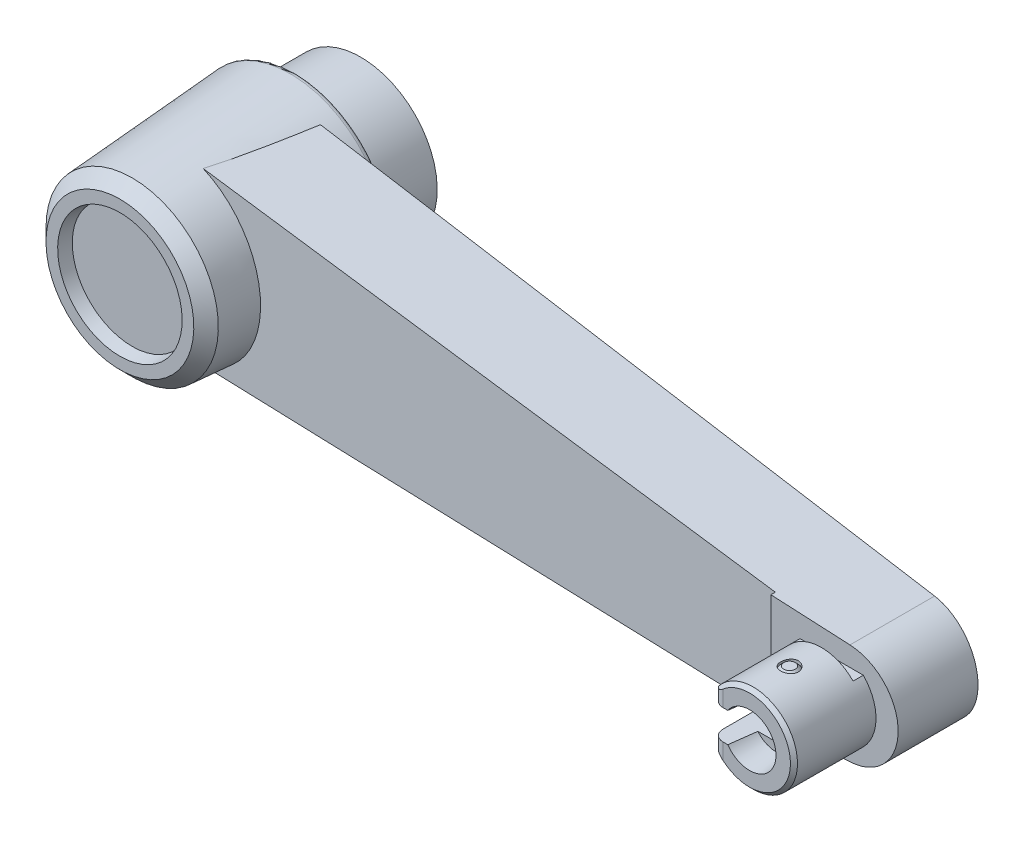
ISO-10303-21;
HEADER;
FILE_DESCRIPTION(('STEP AP214'),'2;1');
FILE_NAME('part.step','',(''),(''),'','','');
FILE_SCHEMA(('AUTOMOTIVE_DESIGN { 1 0 10303 214 1 1 1 1 }'));
ENDSEC;
DATA;
#1=APPLICATION_CONTEXT('core data for automotive mechanical design processes');
#2=APPLICATION_PROTOCOL_DEFINITION('international standard','automotive_design',2000,#1);
#3=PRODUCT_CONTEXT('',#1,'mechanical');
#4=PRODUCT('Part','Part','',(#3));
#5=PRODUCT_RELATED_PRODUCT_CATEGORY('part','',(#4));
#6=PRODUCT_DEFINITION_FORMATION('','',#4);
#7=PRODUCT_DEFINITION_CONTEXT('part definition',#1,'design');
#8=PRODUCT_DEFINITION('design','',#6,#7);
#9=PRODUCT_DEFINITION_SHAPE('','',#8);
#10=(LENGTH_UNIT() NAMED_UNIT(*) SI_UNIT(.MILLI.,.METRE.));
#11=(NAMED_UNIT(*) PLANE_ANGLE_UNIT() SI_UNIT($,.RADIAN.));
#12=(NAMED_UNIT(*) SI_UNIT($,.STERADIAN.) SOLID_ANGLE_UNIT());
#13=UNCERTAINTY_MEASURE_WITH_UNIT(LENGTH_MEASURE(1.E-05),#10,'distance_accuracy_value','');
#14=(GEOMETRIC_REPRESENTATION_CONTEXT(3) GLOBAL_UNCERTAINTY_ASSIGNED_CONTEXT((#13)) GLOBAL_UNIT_ASSIGNED_CONTEXT((#10,
#11,#12)) REPRESENTATION_CONTEXT('',''));
#15=CARTESIAN_POINT('',(0.,0.,0.));
#16=DIRECTION('',(0.,0.,1.));
#17=DIRECTION('',(1.,0.,0.));
#18=AXIS2_PLACEMENT_3D('',#15,#16,#17);
#19=CARTESIAN_POINT('',(160.,0.,54.0000000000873));
#20=DIRECTION('',(0.,0.,-1.));
#21=DIRECTION('',(0.,1.,0.));
#22=AXIS2_PLACEMENT_3D('',#19,#20,#21);
#23=CONICAL_SURFACE('',#22,2.99999999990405,0.785398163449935);
#24=CARTESIAN_POINT('',(160.,0.,54.0000000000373));
#25=DIRECTION('',(0.,0.,-1.));
#26=DIRECTION('',(0.,1.,0.));
#27=AXIS2_PLACEMENT_3D('',#24,#25,#26);
#28=CIRCLE('',#27,2.99999999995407);
#29=CARTESIAN_POINT('',(160.,2.99999999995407,54.0000000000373));
#30=VERTEX_POINT('',#29);
#31=EDGE_CURVE('E9',#30,#30,#28,.F.);
#32=ORIENTED_EDGE('',*,*,#31,.F.);
#33=EDGE_LOOP('',(#32));
#34=FACE_BOUND('',#33,.T.);
#35=CARTESIAN_POINT('',(160.,0.,54.5414999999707));
#36=DIRECTION('',(0.,0.,-1.));
#37=DIRECTION('',(-1.,0.,0.));
#38=AXIS2_PLACEMENT_3D('',#35,#36,#37);
#39=CIRCLE('',#38,2.45849999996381);
#40=CARTESIAN_POINT('',(157.541500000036,0.,54.5414999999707));
#41=VERTEX_POINT('',#40);
#42=EDGE_CURVE('E173',#41,#41,#39,.T.);
#43=ORIENTED_EDGE('',*,*,#42,.F.);
#44=EDGE_LOOP('',(#43));
#45=FACE_BOUND('',#44,.T.);
#46=ADVANCED_FACE('F15',(#34,#45),#23,.F.);
#47=CARTESIAN_POINT('',(160.,0.,56.5));
#48=DIRECTION('',(0.,0.,-1.));
#49=DIRECTION('',(0.,1.,0.));
#50=AXIS2_PLACEMENT_3D('',#47,#48,#49);
#51=CYLINDRICAL_SURFACE('',#50,2.4585);
#52=ORIENTED_EDGE('',*,*,#42,.T.);
#53=EDGE_LOOP('',(#52));
#54=FACE_BOUND('',#53,.T.);
#55=CARTESIAN_POINT('',(160.,0.,58.458499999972));
#56=DIRECTION('',(0.,0.,1.));
#57=DIRECTION('',(-1.,0.,0.));
#58=AXIS2_PLACEMENT_3D('',#55,#56,#57);
#59=CIRCLE('',#58,2.45849999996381);
#60=CARTESIAN_POINT('',(157.541500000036,0.,58.458499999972));
#61=VERTEX_POINT('',#60);
#62=EDGE_CURVE('E172',#61,#61,#59,.T.);
#63=ORIENTED_EDGE('',*,*,#62,.T.);
#64=EDGE_LOOP('',(#63));
#65=FACE_BOUND('',#64,.T.);
#66=ADVANCED_FACE('F709',(#54,#65),#51,.F.);
#67=CARTESIAN_POINT('',(160.,20.,63.5));
#68=DIRECTION('',(0.,1.,0.));
#69=DIRECTION('',(-1.,0.,0.));
#70=AXIS2_PLACEMENT_3D('',#67,#68,#69);
#71=CYLINDRICAL_SURFACE('',#70,1.99);
#72=CARTESIAN_POINT('',(160.,9.31,63.5));
#73=DIRECTION('',(0.,1.,0.));
#74=DIRECTION('',(-1.,0.,0.));
#75=AXIS2_PLACEMENT_3D('',#72,#73,#74);
#76=CIRCLE('',#75,1.99);
#77=CARTESIAN_POINT('',(158.01,9.31,63.5));
#78=VERTEX_POINT('',#77);
#79=EDGE_CURVE('E453',#78,#78,#76,.T.);
#80=ORIENTED_EDGE('',*,*,#79,.F.);
#81=EDGE_LOOP('',(#80));
#82=FACE_BOUND('',#81,.T.);
#83=CARTESIAN_POINT('',(158.01,9.79999489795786,63.5));
#84=CARTESIAN_POINT('',(158.010005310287,9.79999763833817,63.3895298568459));
#85=CARTESIAN_POINT('',(158.019238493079,9.80188491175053,63.2789222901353));
#86=CARTESIAN_POINT('',(158.055922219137,9.80922511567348,63.0607469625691));
#87=CARTESIAN_POINT('',(158.083408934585,9.81468512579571,62.9531856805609));
#88=CARTESIAN_POINT('',(158.155716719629,9.82852805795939,62.7444225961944));
#89=CARTESIAN_POINT('',(158.20051272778,9.83690675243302,62.6432118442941));
#90=CARTESIAN_POINT('',(158.306107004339,9.85563737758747,62.4497762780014));
#91=CARTESIAN_POINT('',(158.366900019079,9.86598866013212,62.3575485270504));
#92=CARTESIAN_POINT('',(158.503683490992,9.88766297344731,62.1833552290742));
#93=CARTESIAN_POINT('',(158.579856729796,9.8989966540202,62.1015344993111));
#94=CARTESIAN_POINT('',(158.744847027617,9.92126545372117,61.9517401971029));
#95=CARTESIAN_POINT('',(158.833665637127,9.93220052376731,61.8837683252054));
#96=CARTESIAN_POINT('',(159.022370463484,9.95255291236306,61.7630511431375));
#97=CARTESIAN_POINT('',(159.12234532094,9.96195636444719,61.7104418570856));
#98=CARTESIAN_POINT('',(159.329932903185,9.97806764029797,61.6228215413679));
#99=CARTESIAN_POINT('',(159.437544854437,9.98477573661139,61.5878087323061));
#100=CARTESIAN_POINT('',(159.6558629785,9.99466601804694,61.5368212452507));
#101=CARTESIAN_POINT('',(159.766510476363,9.99789305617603,61.5206041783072));
#102=CARTESIAN_POINT('',(159.988999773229,10.0006125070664,61.5069123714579));
#103=CARTESIAN_POINT('',(160.100841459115,10.0001052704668,61.5094358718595));
#104=CARTESIAN_POINT('',(160.320877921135,9.99544811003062,61.5329695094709));
#105=CARTESIAN_POINT('',(160.429101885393,9.99134966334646,61.5537184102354));
#106=CARTESIAN_POINT('',(160.640501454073,9.98002857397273,61.6126998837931));
#107=CARTESIAN_POINT('',(160.743676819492,9.97280578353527,61.6509332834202));
#108=CARTESIAN_POINT('',(160.942798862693,9.95596237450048,61.7440424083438));
#109=CARTESIAN_POINT('',(161.03869606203,9.94632697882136,61.7990211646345));
#110=CARTESIAN_POINT('',(161.219993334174,9.92572178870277,61.9239798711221));
#111=CARTESIAN_POINT('',(161.305392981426,9.91475194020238,61.9939604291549));
#112=CARTESIAN_POINT('',(161.464814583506,9.89246776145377,62.1483563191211));
#113=CARTESIAN_POINT('',(161.538617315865,9.88115074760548,62.2329977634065));
#114=CARTESIAN_POINT('',(161.671048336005,9.85962042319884,62.4136118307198));
#115=CARTESIAN_POINT('',(161.729669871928,9.84940760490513,62.509589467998));
#116=CARTESIAN_POINT('',(161.830145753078,9.8312354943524,62.710491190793));
#117=CARTESIAN_POINT('',(161.871951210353,9.82328279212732,62.8154403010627));
#118=CARTESIAN_POINT('',(161.937188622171,9.81062801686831,63.0309332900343));
#119=CARTESIAN_POINT('',(161.960659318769,9.80591909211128,63.141464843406));
#120=CARTESIAN_POINT('',(161.979744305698,9.80207265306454,63.2940310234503));
#121=CARTESIAN_POINT('',(161.983586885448,9.80129532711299,63.3351213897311));
#122=CARTESIAN_POINT('',(161.988715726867,9.80025593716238,63.4174681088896));
#123=CARTESIAN_POINT('',(161.99000198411,9.79999387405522,63.4587244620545));
#124=CARTESIAN_POINT('',(161.989994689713,9.79999763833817,63.6104701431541));
#125=CARTESIAN_POINT('',(161.980761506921,9.80188491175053,63.7210777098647));
#126=CARTESIAN_POINT('',(161.944077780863,9.80922511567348,63.9392530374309));
#127=CARTESIAN_POINT('',(161.916591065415,9.81468512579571,64.0468143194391));
#128=CARTESIAN_POINT('',(161.844283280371,9.82852805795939,64.2555774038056));
#129=CARTESIAN_POINT('',(161.79948727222,9.83690675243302,64.3567881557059));
#130=CARTESIAN_POINT('',(161.693892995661,9.85563737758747,64.5502237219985));
#131=CARTESIAN_POINT('',(161.633099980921,9.86598866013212,64.6424514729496));
#132=CARTESIAN_POINT('',(161.496316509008,9.88766297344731,64.8166447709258));
#133=CARTESIAN_POINT('',(161.420143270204,9.8989966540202,64.8984655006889));
#134=CARTESIAN_POINT('',(161.255152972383,9.92126545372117,65.0482598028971));
#135=CARTESIAN_POINT('',(161.166334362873,9.93220052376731,65.1162316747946));
#136=CARTESIAN_POINT('',(160.977629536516,9.95255291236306,65.2369488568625));
#137=CARTESIAN_POINT('',(160.87765467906,9.96195636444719,65.2895581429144));
#138=CARTESIAN_POINT('',(160.670067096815,9.97806764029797,65.3771784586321));
#139=CARTESIAN_POINT('',(160.562455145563,9.98477573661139,65.4121912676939));
#140=CARTESIAN_POINT('',(160.3441370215,9.99466601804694,65.4631787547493));
#141=CARTESIAN_POINT('',(160.233489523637,9.99789305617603,65.4793958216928));
#142=CARTESIAN_POINT('',(160.011000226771,10.0006125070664,65.4930876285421));
#143=CARTESIAN_POINT('',(159.899158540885,10.0001052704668,65.4905641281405));
#144=CARTESIAN_POINT('',(159.679122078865,9.99544811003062,65.4670304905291));
#145=CARTESIAN_POINT('',(159.570898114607,9.99134966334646,65.4462815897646));
#146=CARTESIAN_POINT('',(159.359498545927,9.98002857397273,65.3873001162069));
#147=CARTESIAN_POINT('',(159.256323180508,9.97280578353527,65.3490667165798));
#148=CARTESIAN_POINT('',(159.057201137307,9.95596237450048,65.2559575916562));
#149=CARTESIAN_POINT('',(158.96130393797,9.94632697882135,65.2009788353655));
#150=CARTESIAN_POINT('',(158.780006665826,9.92572178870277,65.0760201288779));
#151=CARTESIAN_POINT('',(158.694607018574,9.91475194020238,65.0060395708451));
#152=CARTESIAN_POINT('',(158.535185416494,9.89246776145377,64.8516436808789));
#153=CARTESIAN_POINT('',(158.461382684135,9.88115074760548,64.7670022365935));
#154=CARTESIAN_POINT('',(158.328951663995,9.85962042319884,64.5863881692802));
#155=CARTESIAN_POINT('',(158.270330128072,9.84940760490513,64.490410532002));
#156=CARTESIAN_POINT('',(158.169854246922,9.8312354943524,64.289508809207));
#157=CARTESIAN_POINT('',(158.128048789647,9.82328279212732,64.1845596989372));
#158=CARTESIAN_POINT('',(158.062811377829,9.81062801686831,63.9690667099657));
#159=CARTESIAN_POINT('',(158.039340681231,9.80591909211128,63.858535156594));
#160=CARTESIAN_POINT('',(158.020255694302,9.80207265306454,63.7059689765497));
#161=CARTESIAN_POINT('',(158.016413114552,9.80129532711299,63.6648786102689));
#162=CARTESIAN_POINT('',(158.011284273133,9.80025593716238,63.5825318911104));
#163=CARTESIAN_POINT('',(158.00999801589,9.79999387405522,63.5412755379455));
#164=CARTESIAN_POINT('',(158.01,9.79999489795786,63.5));
#165=B_SPLINE_CURVE_WITH_KNOTS('',3,(#83,#84,#85,#86,#87,#88,#89,#90,#91,#92,#93,#94,#95,#96,
#97,#98,#99,#100,#101,#102,#103,#104,#105,#106,#107,#108,#109,#110,#111,#112,#113,#114,#115,
#116,#117,#118,#119,#120,#121,#122,#123,#124,#125,#126,#127,#128,#129,#130,#131,#132,#133,#134,
#135,#136,#137,#138,#139,#140,#141,#142,#143,#144,#145,#146,#147,#148,#149,#150,#151,#152,#153,
#154,#155,#156,#157,#158,#159,#160,#161,#162,#163,#164),.UNSPECIFIED.,.T.,.F.,(4,2,2,2,2,2,2,2,
2,2,2,2,2,2,2,2,2,2,2,2,2,2,2,2,2,2,2,2,2,2,2,2,2,2,2,2,2,2,2,2,4),(0.,0.331252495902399,
0.66316338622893,0.994595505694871,1.32591891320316,1.66143992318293,1.99700210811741,
2.33545112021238,2.67386590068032,3.00786615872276,3.34183505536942,3.67109367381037,
4.00036786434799,4.33171040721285,4.66306637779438,5.00008140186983,5.33724605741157,
5.67538395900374,6.01280541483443,6.13657280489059,6.26034040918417,6.59159290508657,
6.9235037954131,7.25493591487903,7.58625932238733,7.92178033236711,8.25734251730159,
8.59579152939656,8.93420630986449,9.26820656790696,9.60217546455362,9.93143408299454,
10.2607082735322,10.592050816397,10.9234067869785,11.260421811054,11.5975864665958,
11.9357243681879,12.2731458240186,12.3969132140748,12.5206808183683),.UNSPECIFIED.);
#166=CARTESIAN_POINT('',(158.01,9.79999489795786,63.5));
#167=VERTEX_POINT('',#166);
#168=EDGE_CURVE('E186',#167,#167,#165,.T.);
#169=ORIENTED_EDGE('',*,*,#168,.F.);
#170=EDGE_LOOP('',(#169));
#171=FACE_BOUND('',#170,.T.);
#172=ADVANCED_FACE('F203',(#82,#171),#71,.F.);
#173=CARTESIAN_POINT('',(154.,20.,70.));
#174=DIRECTION('',(0.,1.,0.));
#175=DIRECTION('',(-1.,0.,0.));
#176=AXIS2_PLACEMENT_3D('',#173,#174,#175);
#177=CYLINDRICAL_SURFACE('',#176,2.5);
#178=CARTESIAN_POINT('',(151.5,5.26782687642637,70.));
#179=CARTESIAN_POINT('',(151.499993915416,5.26781361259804,70.0407404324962));
#180=CARTESIAN_POINT('',(151.500996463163,5.26943497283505,70.0814575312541));
#181=CARTESIAN_POINT('',(151.504958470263,5.27582141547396,70.1624971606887));
#182=CARTESIAN_POINT('',(151.507915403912,5.28058244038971,70.2028201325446));
#183=CARTESIAN_POINT('',(151.519493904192,5.29917282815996,70.3214260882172));
#184=CARTESIAN_POINT('',(151.530828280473,5.31731957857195,70.3987996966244));
#185=CARTESIAN_POINT('',(151.563982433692,5.36980465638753,70.5705293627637));
#186=CARTESIAN_POINT('',(151.587861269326,5.40727104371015,70.6634983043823));
#187=CARTESIAN_POINT('',(151.644266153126,5.49403389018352,70.8422883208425));
#188=CARTESIAN_POINT('',(151.676903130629,5.54348125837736,70.9279977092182));
#189=CARTESIAN_POINT('',(151.743330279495,5.64184106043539,71.0784748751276));
#190=CARTESIAN_POINT('',(151.776150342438,5.68963890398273,71.1444257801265));
#191=CARTESIAN_POINT('',(151.845973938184,5.7892629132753,71.270983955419));
#192=CARTESIAN_POINT('',(151.882983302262,5.84109466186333,71.3315835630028));
#193=CARTESIAN_POINT('',(151.95949895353,5.94595859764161,71.4460143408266));
#194=CARTESIAN_POINT('',(151.998898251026,5.99890924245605,71.4999932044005));
#195=CARTESIAN_POINT('',(152.080718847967,6.10651962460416,71.6033273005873));
#196=CARTESIAN_POINT('',(152.123129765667,6.16117315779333,71.6526971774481));
#197=CARTESIAN_POINT('',(152.166969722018,6.21640061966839,71.7));
#198=B_SPLINE_CURVE_WITH_KNOTS('',3,(#178,#179,#180,#181,#182,#183,#184,#185,#186,#187,#188,
#189,#190,#191,#192,#193,#194,#195,#196,#197),.UNSPECIFIED.,.F.,.F.,(4,2,2,2,2,2,2,2,2,4),(0.,
0.122134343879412,0.244111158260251,0.483768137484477,0.791215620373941,1.10275773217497,
1.36581050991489,1.62923405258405,1.88482351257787,2.13957107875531),.UNSPECIFIED.);
#199=CARTESIAN_POINT('',(151.5,5.26782687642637,70.));
#200=VERTEX_POINT('',#199);
#201=CARTESIAN_POINT('',(152.166969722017,6.21640061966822,71.7));
#202=VERTEX_POINT('',#201);
#203=EDGE_CURVE('E196',#200,#202,#198,.T.);
#204=ORIENTED_EDGE('',*,*,#203,.F.);
#205=DIRECTION('',(0.,1.,0.));
#206=VECTOR('',#205,1.);
#207=CARTESIAN_POINT('',(151.5,20.,70.));
#208=LINE('',#207,#206);
#209=CARTESIAN_POINT('',(151.5,3.35,70.));
#210=VERTEX_POINT('',#209);
#211=EDGE_CURVE('E286',#200,#210,#208,.F.);
#212=ORIENTED_EDGE('',*,*,#211,.T.);
#213=CARTESIAN_POINT('',(154.,3.35,70.));
#214=DIRECTION('',(0.,1.,0.));
#215=DIRECTION('',(-1.,0.,0.));
#216=AXIS2_PLACEMENT_3D('',#213,#214,#215);
#217=CIRCLE('',#216,2.5);
#218=CARTESIAN_POINT('',(154.,3.35,72.5));
#219=VERTEX_POINT('',#218);
#220=EDGE_CURVE('E287',#210,#219,#217,.T.);
#221=ORIENTED_EDGE('',*,*,#220,.T.);
#222=DIRECTION('',(0.,1.,0.));
#223=VECTOR('',#222,1.);
#224=CARTESIAN_POINT('',(154.,20.,72.5));
#225=LINE('',#224,#223);
#226=CARTESIAN_POINT('',(154.,6.97423830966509,72.5));
#227=VERTEX_POINT('',#226);
#228=EDGE_CURVE('E438',#219,#227,#225,.T.);
#229=ORIENTED_EDGE('',*,*,#228,.T.);
#230=CARTESIAN_POINT('',(152.166969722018,6.2164006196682,71.7));
#231=CARTESIAN_POINT('',(152.188591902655,6.20613655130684,71.7233161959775));
#232=CARTESIAN_POINT('',(152.210901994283,6.19698663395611,71.7464764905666));
#233=CARTESIAN_POINT('',(152.256831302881,6.18105975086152,71.7923216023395));
#234=CARTESIAN_POINT('',(152.280450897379,6.17428347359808,71.8150062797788));
#235=CARTESIAN_POINT('',(152.352828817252,6.157814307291,71.881780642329));
#236=CARTESIAN_POINT('',(152.40339892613,6.15183941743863,71.9249085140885));
#237=CARTESIAN_POINT('',(152.508027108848,6.15009251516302,72.0071025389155));
#238=CARTESIAN_POINT('',(152.562092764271,6.15434345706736,72.0461593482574));
#239=CARTESIAN_POINT('',(152.672040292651,6.17211895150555,72.1191713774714));
#240=CARTESIAN_POINT('',(152.727922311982,6.18564425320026,72.1531261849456));
#241=CARTESIAN_POINT('',(152.863056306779,6.22744967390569,72.2283456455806));
#242=CARTESIAN_POINT('',(152.942588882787,6.25949014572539,72.266984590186));
#243=CARTESIAN_POINT('',(153.101207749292,6.33456272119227,72.3344575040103));
#244=CARTESIAN_POINT('',(153.180285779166,6.37767824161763,72.3632130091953));
#245=CARTESIAN_POINT('',(153.32374330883,6.46363541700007,72.4077675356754));
#246=CARTESIAN_POINT('',(153.388398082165,6.50535201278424,72.4249206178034));
#247=CARTESIAN_POINT('',(153.516397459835,6.59268899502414,72.4536577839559));
#248=CARTESIAN_POINT('',(153.579740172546,6.63831458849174,72.4652342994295));
#249=CARTESIAN_POINT('',(153.703445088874,6.73127677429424,72.483116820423));
#250=CARTESIAN_POINT('',(153.763842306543,6.77854450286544,72.4895444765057));
#251=CARTESIAN_POINT('',(153.883055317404,6.87504174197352,72.4979718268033));
#252=CARTESIAN_POINT('',(153.94187552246,6.92426454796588,72.4999855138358));
#253=CARTESIAN_POINT('',(154.,6.97423830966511,72.5));
#254=B_SPLINE_CURVE_WITH_KNOTS('',3,(#230,#231,#232,#233,#234,#235,#236,#237,#238,#239,#240,
#241,#242,#243,#244,#245,#246,#247,#248,#249,#250,#251,#252,#253),.UNSPECIFIED.,.F.,.F.,(4,2,2,
2,2,2,2,2,2,2,2,4),(0.,0.100199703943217,0.200428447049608,0.39953940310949,0.599097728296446,
0.798672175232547,1.0792396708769,1.3619857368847,1.59815115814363,1.83463620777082,
2.06535392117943,2.29533916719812),.UNSPECIFIED.);
#255=EDGE_CURVE('E277',#202,#227,#254,.T.);
#256=ORIENTED_EDGE('',*,*,#255,.F.);
#257=EDGE_LOOP('',(#204,#212,#221,#229,#256));
#258=FACE_BOUND('',#257,.T.);
#259=ADVANCED_FACE('F212',(#258),#177,.T.);
#260=CARTESIAN_POINT('',(160.,0.,62.85));
#261=DIRECTION('',(0.,0.,-1.));
#262=DIRECTION('',(0.,1.,0.));
#263=AXIS2_PLACEMENT_3D('',#260,#261,#262);
#264=CYLINDRICAL_SURFACE('',#263,10.);
#265=DIRECTION('',(0.,0.,-1.));
#266=VECTOR('',#265,1.);
#267=CARTESIAN_POINT('',(167.141428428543,-6.99999999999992,62.85));
#268=LINE('',#267,#266);
#269=CARTESIAN_POINT('',(167.141428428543,-7.,56.3));
#270=VERTEX_POINT('',#269);
#271=CARTESIAN_POINT('',(167.141428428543,-7.,54.));
#272=VERTEX_POINT('',#271);
#273=EDGE_CURVE('E449',#270,#272,#268,.T.);
#274=ORIENTED_EDGE('',*,*,#273,.T.);
#275=CARTESIAN_POINT('',(160.,0.,54.));
#276=DIRECTION('',(0.,0.,-1.));
#277=DIRECTION('',(0.,1.,0.));
#278=AXIS2_PLACEMENT_3D('',#275,#276,#277);
#279=CIRCLE('',#278,10.);
#280=CARTESIAN_POINT('',(167.141428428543,7.,54.));
#281=VERTEX_POINT('',#280);
#282=EDGE_CURVE('E423',#281,#272,#279,.T.);
#283=ORIENTED_EDGE('',*,*,#282,.F.);
#284=DIRECTION('',(0.,0.,-1.));
#285=VECTOR('',#284,1.);
#286=CARTESIAN_POINT('',(167.141428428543,6.99999999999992,62.85));
#287=LINE('',#286,#285);
#288=CARTESIAN_POINT('',(167.141428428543,7.,56.3));
#289=VERTEX_POINT('',#288);
#290=EDGE_CURVE('E450',#281,#289,#287,.F.);
#291=ORIENTED_EDGE('',*,*,#290,.T.);
#292=CARTESIAN_POINT('',(160.,0.,56.3));
#293=DIRECTION('',(0.,0.,-1.));
#294=DIRECTION('',(0.,1.,0.));
#295=AXIS2_PLACEMENT_3D('',#292,#293,#294);
#296=CIRCLE('',#295,10.);
#297=CARTESIAN_POINT('',(152.858571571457,7.,56.3));
#298=VERTEX_POINT('',#297);
#299=EDGE_CURVE('E445',#289,#298,#296,.F.);
#300=ORIENTED_EDGE('',*,*,#299,.T.);
#301=DIRECTION('',(0.,0.,-1.));
#302=VECTOR('',#301,1.);
#303=CARTESIAN_POINT('',(152.858571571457,6.99999999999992,62.85));
#304=LINE('',#303,#302);
#305=CARTESIAN_POINT('',(152.858571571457,7.,54.));
#306=VERTEX_POINT('',#305);
#307=EDGE_CURVE('E435',#298,#306,#304,.T.);
#308=ORIENTED_EDGE('',*,*,#307,.T.);
#309=CARTESIAN_POINT('',(151.5,5.26782687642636,54.));
#310=VERTEX_POINT('',#309);
#311=EDGE_CURVE('E418',#310,#306,#279,.T.);
#312=ORIENTED_EDGE('',*,*,#311,.F.);
#313=DIRECTION('',(0.,0.,-1.));
#314=VECTOR('',#313,1.);
#315=CARTESIAN_POINT('',(151.5,5.26782687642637,62.85));
#316=LINE('',#315,#314);
#317=EDGE_CURVE('E432',#310,#200,#316,.F.);
#318=ORIENTED_EDGE('',*,*,#317,.T.);
#319=ORIENTED_EDGE('',*,*,#203,.T.);
#320=CARTESIAN_POINT('',(160.,0.,71.7));
#321=DIRECTION('',(0.,0.,-1.));
#322=DIRECTION('',(0.,1.,0.));
#323=AXIS2_PLACEMENT_3D('',#320,#321,#322);
#324=CIRCLE('',#323,10.);
#325=CARTESIAN_POINT('',(152.166969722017,-6.21640061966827,71.7));
#326=VERTEX_POINT('',#325);
#327=EDGE_CURVE('E195',#202,#326,#324,.T.);
#328=ORIENTED_EDGE('',*,*,#327,.T.);
#329=CARTESIAN_POINT('',(152.166969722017,-6.21640061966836,71.7));
#330=CARTESIAN_POINT('',(152.124021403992,-6.16229561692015,71.6536615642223));
#331=CARTESIAN_POINT('',(152.082445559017,-6.10874371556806,71.6053373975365));
#332=CARTESIAN_POINT('',(152.002176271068,-6.00326427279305,71.5042950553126));
#333=CARTESIAN_POINT('',(151.963492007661,-5.95134218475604,71.4515639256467));
#334=CARTESIAN_POINT('',(151.888440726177,-5.84865470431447,71.34012743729));
#335=CARTESIAN_POINT('',(151.852160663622,-5.79795498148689,71.2813019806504));
#336=CARTESIAN_POINT('',(151.783551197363,-5.70030896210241,71.1585728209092));
#337=CARTESIAN_POINT('',(151.751216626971,-5.65335778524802,71.0946759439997));
#338=CARTESIAN_POINT('',(151.687913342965,-5.55992068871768,70.9543542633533));
#339=CARTESIAN_POINT('',(151.657444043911,-5.51400063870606,70.8773184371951));
#340=CARTESIAN_POINT('',(151.603565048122,-5.43160046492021,70.7170361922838));
#341=CARTESIAN_POINT('',(151.580080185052,-5.39502047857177,70.6338688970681));
#342=CARTESIAN_POINT('',(151.551099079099,-5.34942970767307,70.5047938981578));
#343=CARTESIAN_POINT('',(151.542496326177,-5.33580649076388,70.4611857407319));
#344=CARTESIAN_POINT('',(151.527525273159,-5.31200226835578,70.3726685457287));
#345=CARTESIAN_POINT('',(151.521156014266,-5.30181978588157,70.3277600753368));
#346=CARTESIAN_POINT('',(151.510733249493,-5.2851164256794,70.2360451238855));
#347=CARTESIAN_POINT('',(151.506729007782,-5.27867348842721,70.1892186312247));
#348=CARTESIAN_POINT('',(151.50135193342,-5.27000825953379,70.0949366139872));
#349=CARTESIAN_POINT('',(151.49998435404,-5.26779439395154,70.0474800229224));
#350=CARTESIAN_POINT('',(151.5,-5.26782687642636,70.));
#351=B_SPLINE_CURVE_WITH_KNOTS('',3,(#329,#330,#331,#332,#333,#334,#335,#336,#337,#338,#339,
#340,#341,#342,#343,#344,#345,#346,#347,#348,#349,#350),.UNSPECIFIED.,.F.,.F.,(4,2,2,2,2,2,2,2,
2,2,4),(0.,0.249563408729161,0.499888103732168,0.756753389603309,1.01327861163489,
1.2967235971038,1.57699751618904,1.71629941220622,1.85554143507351,1.99759003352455,
2.13992135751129),.UNSPECIFIED.);
#352=CARTESIAN_POINT('',(151.5,-5.26782687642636,70.));
#353=VERTEX_POINT('',#352);
#354=EDGE_CURVE('E229',#326,#353,#351,.T.);
#355=ORIENTED_EDGE('',*,*,#354,.T.);
#356=DIRECTION('',(0.,0.,1.));
#357=VECTOR('',#356,1.);
#358=CARTESIAN_POINT('',(151.5,-5.26782687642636,70.));
#359=LINE('',#358,#357);
#360=CARTESIAN_POINT('',(151.5,-5.26782687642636,54.));
#361=VERTEX_POINT('',#360);
#362=EDGE_CURVE('E468',#353,#361,#359,.F.);
#363=ORIENTED_EDGE('',*,*,#362,.T.);
#364=CARTESIAN_POINT('',(160.,0.,54.));
#365=DIRECTION('',(0.,0.,-1.));
#366=DIRECTION('',(0.,1.,0.));
#367=AXIS2_PLACEMENT_3D('',#364,#365,#366);
#368=CIRCLE('',#367,10.);
#369=CARTESIAN_POINT('',(152.858571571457,-7.,54.));
#370=VERTEX_POINT('',#369);
#371=EDGE_CURVE('E427',#370,#361,#368,.T.);
#372=ORIENTED_EDGE('',*,*,#371,.F.);
#373=DIRECTION('',(0.,0.,-1.));
#374=VECTOR('',#373,1.);
#375=CARTESIAN_POINT('',(152.858571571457,-6.99999999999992,62.85));
#376=LINE('',#375,#374);
#377=CARTESIAN_POINT('',(152.858571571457,-7.,56.3));
#378=VERTEX_POINT('',#377);
#379=EDGE_CURVE('E237',#370,#378,#376,.F.);
#380=ORIENTED_EDGE('',*,*,#379,.T.);
#381=CARTESIAN_POINT('',(160.,0.,56.3));
#382=DIRECTION('',(0.,0.,-1.));
#383=DIRECTION('',(0.,1.,0.));
#384=AXIS2_PLACEMENT_3D('',#381,#382,#383);
#385=CIRCLE('',#384,10.);
#386=EDGE_CURVE('E238',#378,#270,#385,.F.);
#387=ORIENTED_EDGE('',*,*,#386,.T.);
#388=EDGE_LOOP('',(#274,#283,#291,#300,#308,#312,#318,#319,#328,#355,#363,#372,#380,#387));
#389=FACE_BOUND('',#388,.T.);
#390=CARTESIAN_POINT('',(158.01,-9.79999489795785,63.5));
#391=CARTESIAN_POINT('',(158.010005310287,-9.79999763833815,63.6104701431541));
#392=CARTESIAN_POINT('',(158.019238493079,-9.80188491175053,63.7210777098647));
#393=CARTESIAN_POINT('',(158.055922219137,-9.80922511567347,63.9392530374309));
#394=CARTESIAN_POINT('',(158.083408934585,-9.8146851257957,64.0468143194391));
#395=CARTESIAN_POINT('',(158.155716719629,-9.82852805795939,64.2555774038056));
#396=CARTESIAN_POINT('',(158.20051272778,-9.83690675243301,64.3567881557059));
#397=CARTESIAN_POINT('',(158.306107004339,-9.85563737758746,64.5502237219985));
#398=CARTESIAN_POINT('',(158.366900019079,-9.86598866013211,64.6424514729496));
#399=CARTESIAN_POINT('',(158.503683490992,-9.88766297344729,64.8166447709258));
#400=CARTESIAN_POINT('',(158.579856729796,-9.89899665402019,64.8984655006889));
#401=CARTESIAN_POINT('',(158.744847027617,-9.92126545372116,65.0482598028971));
#402=CARTESIAN_POINT('',(158.833665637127,-9.93220052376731,65.1162316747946));
#403=CARTESIAN_POINT('',(159.022370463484,-9.95255291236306,65.2369488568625));
#404=CARTESIAN_POINT('',(159.12234532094,-9.96195636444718,65.2895581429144));
#405=CARTESIAN_POINT('',(159.329932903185,-9.97806764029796,65.3771784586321));
#406=CARTESIAN_POINT('',(159.437544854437,-9.98477573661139,65.4121912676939));
#407=CARTESIAN_POINT('',(159.6558629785,-9.99466601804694,65.4631787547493));
#408=CARTESIAN_POINT('',(159.766510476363,-9.99789305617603,65.4793958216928));
#409=CARTESIAN_POINT('',(159.988999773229,-10.0006125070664,65.4930876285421));
#410=CARTESIAN_POINT('',(160.100841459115,-10.0001052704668,65.4905641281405));
#411=CARTESIAN_POINT('',(160.320877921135,-9.99544811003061,65.4670304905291));
#412=CARTESIAN_POINT('',(160.429101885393,-9.99134966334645,65.4462815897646));
#413=CARTESIAN_POINT('',(160.640501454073,-9.98002857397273,65.3873001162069));
#414=CARTESIAN_POINT('',(160.743676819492,-9.97280578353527,65.3490667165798));
#415=CARTESIAN_POINT('',(160.942798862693,-9.95596237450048,65.2559575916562));
#416=CARTESIAN_POINT('',(161.03869606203,-9.94632697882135,65.2009788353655));
#417=CARTESIAN_POINT('',(161.219993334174,-9.92572178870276,65.0760201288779));
#418=CARTESIAN_POINT('',(161.305392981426,-9.91475194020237,65.0060395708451));
#419=CARTESIAN_POINT('',(161.464814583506,-9.89246776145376,64.8516436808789));
#420=CARTESIAN_POINT('',(161.538617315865,-9.88115074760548,64.7670022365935));
#421=CARTESIAN_POINT('',(161.671048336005,-9.85962042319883,64.5863881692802));
#422=CARTESIAN_POINT('',(161.729669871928,-9.84940760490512,64.490410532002));
#423=CARTESIAN_POINT('',(161.830145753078,-9.83123549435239,64.289508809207));
#424=CARTESIAN_POINT('',(161.871951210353,-9.82328279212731,64.1845596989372));
#425=CARTESIAN_POINT('',(161.937188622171,-9.81062801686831,63.9690667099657));
#426=CARTESIAN_POINT('',(161.960659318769,-9.80591909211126,63.858535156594));
#427=CARTESIAN_POINT('',(161.979744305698,-9.80207265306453,63.7059689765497));
#428=CARTESIAN_POINT('',(161.983586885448,-9.80129532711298,63.6648786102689));
#429=CARTESIAN_POINT('',(161.988715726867,-9.80025593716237,63.5825318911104));
#430=CARTESIAN_POINT('',(161.99000198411,-9.79999387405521,63.5412755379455));
#431=CARTESIAN_POINT('',(161.989994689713,-9.79999763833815,63.389529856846));
#432=CARTESIAN_POINT('',(161.980761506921,-9.80188491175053,63.2789222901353));
#433=CARTESIAN_POINT('',(161.944077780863,-9.80922511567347,63.0607469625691));
#434=CARTESIAN_POINT('',(161.916591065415,-9.8146851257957,62.9531856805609));
#435=CARTESIAN_POINT('',(161.844283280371,-9.82852805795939,62.7444225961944));
#436=CARTESIAN_POINT('',(161.79948727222,-9.83690675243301,62.6432118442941));
#437=CARTESIAN_POINT('',(161.693892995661,-9.85563737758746,62.4497762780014));
#438=CARTESIAN_POINT('',(161.633099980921,-9.86598866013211,62.3575485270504));
#439=CARTESIAN_POINT('',(161.496316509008,-9.88766297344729,62.1833552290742));
#440=CARTESIAN_POINT('',(161.420143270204,-9.89899665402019,62.1015344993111));
#441=CARTESIAN_POINT('',(161.255152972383,-9.92126545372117,61.9517401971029));
#442=CARTESIAN_POINT('',(161.166334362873,-9.93220052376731,61.8837683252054));
#443=CARTESIAN_POINT('',(160.977629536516,-9.95255291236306,61.7630511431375));
#444=CARTESIAN_POINT('',(160.87765467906,-9.96195636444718,61.7104418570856));
#445=CARTESIAN_POINT('',(160.670067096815,-9.97806764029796,61.6228215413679));
#446=CARTESIAN_POINT('',(160.562455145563,-9.98477573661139,61.5878087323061));
#447=CARTESIAN_POINT('',(160.3441370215,-9.99466601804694,61.5368212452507));
#448=CARTESIAN_POINT('',(160.233489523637,-9.99789305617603,61.5206041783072));
#449=CARTESIAN_POINT('',(160.011000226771,-10.0006125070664,61.5069123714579));
#450=CARTESIAN_POINT('',(159.899158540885,-10.0001052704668,61.5094358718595));
#451=CARTESIAN_POINT('',(159.679122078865,-9.99544811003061,61.5329695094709));
#452=CARTESIAN_POINT('',(159.570898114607,-9.99134966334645,61.5537184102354));
#453=CARTESIAN_POINT('',(159.359498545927,-9.98002857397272,61.6126998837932));
#454=CARTESIAN_POINT('',(159.256323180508,-9.97280578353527,61.6509332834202));
#455=CARTESIAN_POINT('',(159.057201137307,-9.95596237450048,61.7440424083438));
#456=CARTESIAN_POINT('',(158.96130393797,-9.94632697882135,61.7990211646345));
#457=CARTESIAN_POINT('',(158.780006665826,-9.92572178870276,61.9239798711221));
#458=CARTESIAN_POINT('',(158.694607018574,-9.91475194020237,61.9939604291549));
#459=CARTESIAN_POINT('',(158.535185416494,-9.89246776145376,62.1483563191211));
#460=CARTESIAN_POINT('',(158.461382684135,-9.88115074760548,62.2329977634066));
#461=CARTESIAN_POINT('',(158.328951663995,-9.85962042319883,62.4136118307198));
#462=CARTESIAN_POINT('',(158.270330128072,-9.84940760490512,62.509589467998));
#463=CARTESIAN_POINT('',(158.169854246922,-9.83123549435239,62.710491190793));
#464=CARTESIAN_POINT('',(158.128048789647,-9.82328279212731,62.8154403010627));
#465=CARTESIAN_POINT('',(158.062811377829,-9.81062801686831,63.0309332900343));
#466=CARTESIAN_POINT('',(158.039340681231,-9.80591909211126,63.141464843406));
#467=CARTESIAN_POINT('',(158.020255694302,-9.80207265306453,63.2940310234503));
#468=CARTESIAN_POINT('',(158.016413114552,-9.80129532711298,63.3351213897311));
#469=CARTESIAN_POINT('',(158.011284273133,-9.80025593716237,63.4174681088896));
#470=CARTESIAN_POINT('',(158.00999801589,-9.79999387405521,63.4587244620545));
#471=CARTESIAN_POINT('',(158.01,-9.79999489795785,63.5));
#472=B_SPLINE_CURVE_WITH_KNOTS('',3,(#390,#391,#392,#393,#394,#395,#396,#397,#398,#399,#400,
#401,#402,#403,#404,#405,#406,#407,#408,#409,#410,#411,#412,#413,#414,#415,#416,#417,#418,#419,
#420,#421,#422,#423,#424,#425,#426,#427,#428,#429,#430,#431,#432,#433,#434,#435,#436,#437,#438,
#439,#440,#441,#442,#443,#444,#445,#446,#447,#448,#449,#450,#451,#452,#453,#454,#455,#456,#457,
#458,#459,#460,#461,#462,#463,#464,#465,#466,#467,#468,#469,#470,#471),.UNSPECIFIED.,.T.,.F.,(4,
2,2,2,2,2,2,2,2,2,2,2,2,2,2,2,2,2,2,2,2,2,2,2,2,2,2,2,2,2,2,2,2,2,2,2,2,2,2,2,4),(0.,
0.331252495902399,0.66316338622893,0.994595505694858,1.32591891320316,1.66143992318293,
1.99700210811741,2.33545112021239,2.67386590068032,3.00786615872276,3.34183505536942,
3.67109367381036,4.00036786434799,4.33171040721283,4.66306637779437,5.00008140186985,
5.33724605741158,5.67538395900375,6.01280541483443,6.13657280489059,6.26034040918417,
6.59159290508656,6.9235037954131,7.25493591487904,7.58625932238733,7.9217803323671,
8.25734251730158,8.59579152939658,8.93420630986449,9.26820656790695,9.60217546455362,
9.93143408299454,10.2607082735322,10.592050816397,10.9234067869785,11.260421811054,
11.5975864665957,11.9357243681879,12.2731458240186,12.3969132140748,12.5206808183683),.UNSPECIFIED.);
#473=CARTESIAN_POINT('',(158.01,-9.79999489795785,63.5));
#474=VERTEX_POINT('',#473);
#475=EDGE_CURVE('E221',#474,#474,#472,.T.);
#476=ORIENTED_EDGE('',*,*,#475,.T.);
#477=EDGE_LOOP('',(#476));
#478=FACE_BOUND('',#477,.T.);
#479=ORIENTED_EDGE('',*,*,#168,.T.);
#480=EDGE_LOOP('',(#479));
#481=FACE_BOUND('',#480,.T.);
#482=ADVANCED_FACE('F206',(#389,#478,#481),#264,.T.);
#483=CARTESIAN_POINT('',(140.,7.,54.));
#484=DIRECTION('',(0.,-1.,0.));
#485=DIRECTION('',(1.,0.,0.));
#486=AXIS2_PLACEMENT_3D('',#483,#484,#485);
#487=PLANE('',#486);
#488=DIRECTION('',(1.,0.,0.));
#489=VECTOR('',#488,1.);
#490=CARTESIAN_POINT('',(155.,7.,54.));
#491=LINE('',#490,#489);
#492=EDGE_CURVE('E426',#306,#281,#491,.T.);
#493=ORIENTED_EDGE('',*,*,#492,.F.);
#494=ORIENTED_EDGE('',*,*,#307,.F.);
#495=DIRECTION('',(1.,0.,0.));
#496=VECTOR('',#495,1.);
#497=CARTESIAN_POINT('',(140.,7.,56.3));
#498=LINE('',#497,#496);
#499=EDGE_CURVE('E446',#289,#298,#498,.F.);
#500=ORIENTED_EDGE('',*,*,#499,.F.);
#501=ORIENTED_EDGE('',*,*,#290,.F.);
#502=EDGE_LOOP('',(#493,#494,#500,#501));
#503=FACE_BOUND('',#502,.T.);
#504=ADVANCED_FACE('F211',(#503),#487,.F.);
#505=CARTESIAN_POINT('',(140.,7.,56.3));
#506=DIRECTION('',(0.,0.,1.));
#507=DIRECTION('',(0.,-1.,0.));
#508=AXIS2_PLACEMENT_3D('',#505,#506,#507);
#509=PLANE('',#508);
#510=ORIENTED_EDGE('',*,*,#499,.T.);
#511=ORIENTED_EDGE('',*,*,#299,.F.);
#512=EDGE_LOOP('',(#510,#511));
#513=FACE_BOUND('',#512,.T.);
#514=ADVANCED_FACE('F214',(#513),#509,.F.);
#515=CARTESIAN_POINT('',(151.5,20.,70.));
#516=DIRECTION('',(1.,0.,0.));
#517=DIRECTION('',(0.,1.,0.));
#518=AXIS2_PLACEMENT_3D('',#515,#516,#517);
#519=PLANE('',#518);
#520=DIRECTION('',(0.,1.,0.));
#521=VECTOR('',#520,1.);
#522=CARTESIAN_POINT('',(151.5,20.,59.));
#523=LINE('',#522,#521);
#524=CARTESIAN_POINT('',(151.5,3.35,59.));
#525=VERTEX_POINT('',#524);
#526=CARTESIAN_POINT('',(151.5,-3.35,59.));
#527=VERTEX_POINT('',#526);
#528=EDGE_CURVE('E467',#525,#527,#523,.F.);
#529=ORIENTED_EDGE('',*,*,#528,.F.);
#530=DIRECTION('',(0.,0.,1.));
#531=VECTOR('',#530,1.);
#532=CARTESIAN_POINT('',(151.5,3.35,70.));
#533=LINE('',#532,#531);
#534=EDGE_CURVE('E465',#210,#525,#533,.F.);
#535=ORIENTED_EDGE('',*,*,#534,.F.);
#536=ORIENTED_EDGE('',*,*,#211,.F.);
#537=ORIENTED_EDGE('',*,*,#317,.F.);
#538=DIRECTION('',(0.,-1.,0.));
#539=VECTOR('',#538,1.);
#540=CARTESIAN_POINT('',(151.5,-39.5,54.));
#541=LINE('',#540,#539);
#542=EDGE_CURVE('E421',#310,#361,#541,.T.);
#543=ORIENTED_EDGE('',*,*,#542,.T.);
#544=ORIENTED_EDGE('',*,*,#362,.F.);
#545=DIRECTION('',(0.,1.,0.));
#546=VECTOR('',#545,1.);
#547=CARTESIAN_POINT('',(151.5,20.,70.));
#548=LINE('',#547,#546);
#549=CARTESIAN_POINT('',(151.5,-3.35,70.));
#550=VERTEX_POINT('',#549);
#551=EDGE_CURVE('E448',#550,#353,#548,.F.);
#552=ORIENTED_EDGE('',*,*,#551,.F.);
#553=DIRECTION('',(0.,0.,1.));
#554=VECTOR('',#553,1.);
#555=CARTESIAN_POINT('',(151.5,-3.35,70.));
#556=LINE('',#555,#554);
#557=EDGE_CURVE('E473',#527,#550,#556,.T.);
#558=ORIENTED_EDGE('',*,*,#557,.F.);
#559=EDGE_LOOP('',(#529,#535,#536,#537,#543,#544,#552,#558));
#560=FACE_BOUND('',#559,.T.);
#561=ADVANCED_FACE('F292',(#560),#519,.F.);
#562=CARTESIAN_POINT('',(160.,0.,59.));
#563=DIRECTION('',(0.,0.,1.));
#564=DIRECTION('',(0.,-1.,0.));
#565=AXIS2_PLACEMENT_3D('',#562,#563,#564);
#566=PLANE('',#565);
#567=CARTESIAN_POINT('',(163.5,2.35,59.));
#568=DIRECTION('',(0.,0.,-1.));
#569=DIRECTION('',(0.,1.,0.));
#570=AXIS2_PLACEMENT_3D('',#567,#568,#569);
#571=CIRCLE('',#570,1.);
#572=CARTESIAN_POINT('',(164.5,2.35,59.));
#573=VERTEX_POINT('',#572);
#574=CARTESIAN_POINT('',(163.5,3.35,59.));
#575=VERTEX_POINT('',#574);
#576=EDGE_CURVE('E488',#573,#575,#571,.F.);
#577=ORIENTED_EDGE('',*,*,#576,.T.);
#578=DIRECTION('',(-1.,0.,0.));
#579=VECTOR('',#578,1.);
#580=CARTESIAN_POINT('',(144.5,3.35,59.));
#581=LINE('',#580,#579);
#582=EDGE_CURVE('E156',#575,#525,#581,.T.);
#583=ORIENTED_EDGE('',*,*,#582,.T.);
#584=ORIENTED_EDGE('',*,*,#528,.T.);
#585=DIRECTION('',(1.,0.,0.));
#586=VECTOR('',#585,1.);
#587=CARTESIAN_POINT('',(163.5,-3.35,59.));
#588=LINE('',#587,#586);
#589=CARTESIAN_POINT('',(163.5,-3.35,59.));
#590=VERTEX_POINT('',#589);
#591=EDGE_CURVE('E168',#527,#590,#588,.T.);
#592=ORIENTED_EDGE('',*,*,#591,.T.);
#593=CARTESIAN_POINT('',(163.5,-2.35,59.));
#594=DIRECTION('',(0.,0.,-1.));
#595=DIRECTION('',(0.,1.,0.));
#596=AXIS2_PLACEMENT_3D('',#593,#594,#595);
#597=CIRCLE('',#596,1.);
#598=CARTESIAN_POINT('',(164.5,-2.35,59.));
#599=VERTEX_POINT('',#598);
#600=EDGE_CURVE('E489',#590,#599,#597,.F.);
#601=ORIENTED_EDGE('',*,*,#600,.T.);
#602=DIRECTION('',(0.,-1.,0.));
#603=VECTOR('',#602,1.);
#604=CARTESIAN_POINT('',(164.5,0.,59.));
#605=LINE('',#604,#603);
#606=EDGE_CURVE('E486',#599,#573,#605,.F.);
#607=ORIENTED_EDGE('',*,*,#606,.T.);
#608=EDGE_LOOP('',(#577,#583,#584,#592,#601,#607));
#609=FACE_BOUND('',#608,.T.);
#610=CARTESIAN_POINT('',(160.,0.,58.9999999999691));
#611=DIRECTION('',(0.,0.,1.));
#612=DIRECTION('',(0.,-1.,0.));
#613=AXIS2_PLACEMENT_3D('',#610,#611,#612);
#614=CIRCLE('',#613,2.9999999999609);
#615=CARTESIAN_POINT('',(160.,-2.99999999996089,58.9999999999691));
#616=VERTEX_POINT('',#615);
#617=EDGE_CURVE('E262',#616,#616,#614,.F.);
#618=ORIENTED_EDGE('',*,*,#617,.T.);
#619=EDGE_LOOP('',(#618));
#620=FACE_BOUND('',#619,.T.);
#621=ADVANCED_FACE('F247',(#609,#620),#566,.T.);
#622=CARTESIAN_POINT('',(144.5,3.35,59.));
#623=DIRECTION('',(0.,1.,0.));
#624=DIRECTION('',(-1.,0.,0.));
#625=AXIS2_PLACEMENT_3D('',#622,#623,#624);
#626=PLANE('',#625);
#627=CARTESIAN_POINT('',(155.085772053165,3.35,72.4999999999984));
#628=CARTESIAN_POINT('',(155.149406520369,3.35,71.9997621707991));
#629=CARTESIAN_POINT('',(155.213421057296,3.35,71.4995725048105));
#630=CARTESIAN_POINT('',(155.342320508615,3.35,70.4993073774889));
#631=CARTESIAN_POINT('',(155.407205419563,3.35,69.999231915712));
#632=CARTESIAN_POINT('',(155.537956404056,3.35,68.9992087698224));
#633=CARTESIAN_POINT('',(155.603822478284,3.35,68.499261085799));
#634=CARTESIAN_POINT('',(155.736682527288,3.35,67.4995136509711));
#635=CARTESIAN_POINT('',(155.803676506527,3.35,66.99971390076));
#636=CARTESIAN_POINT('',(155.871307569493,3.35,66.5000000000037));
#637=B_SPLINE_CURVE_WITH_KNOTS('',3,(#627,#628,#629,#630,#631,#632,#633,#634,#635,#636),
.UNSPECIFIED.,.F.,.F.,(4,2,2,2,4),(0.,1.51280713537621,3.02560828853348,4.53841049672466,
6.05121869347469),.UNSPECIFIED.);
#638=CARTESIAN_POINT('',(155.085772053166,3.35,72.4999999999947));
#639=VERTEX_POINT('',#638);
#640=CARTESIAN_POINT('',(155.871307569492,3.35,66.5000000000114));
#641=VERTEX_POINT('',#640);
#642=EDGE_CURVE('E150',#639,#641,#637,.T.);
#643=ORIENTED_EDGE('',*,*,#642,.F.);
#644=DIRECTION('',(1.,0.,0.));
#645=VECTOR('',#644,1.);
#646=CARTESIAN_POINT('',(152.426276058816,3.35,72.5));
#647=LINE('',#646,#645);
#648=EDGE_CURVE('E456',#219,#639,#647,.T.);
#649=ORIENTED_EDGE('',*,*,#648,.F.);
#650=ORIENTED_EDGE('',*,*,#220,.F.);
#651=ORIENTED_EDGE('',*,*,#534,.T.);
#652=ORIENTED_EDGE('',*,*,#582,.F.);
#653=DIRECTION('',(0.,0.,1.));
#654=VECTOR('',#653,1.);
#655=CARTESIAN_POINT('',(163.5,3.35,59.));
#656=LINE('',#655,#654);
#657=CARTESIAN_POINT('',(163.5,3.35,66.5));
#658=VERTEX_POINT('',#657);
#659=EDGE_CURVE('E133',#658,#575,#656,.F.);
#660=ORIENTED_EDGE('',*,*,#659,.F.);
#661=DIRECTION('',(-1.,0.,0.));
#662=VECTOR('',#661,1.);
#663=CARTESIAN_POINT('',(144.5,3.35,66.5));
#664=LINE('',#663,#662);
#665=EDGE_CURVE('E142',#641,#658,#664,.F.);
#666=ORIENTED_EDGE('',*,*,#665,.F.);
#667=EDGE_LOOP('',(#643,#649,#650,#651,#652,#660,#666));
#668=FACE_BOUND('',#667,.T.);
#669=CARTESIAN_POINT('',(160.,3.35,63.5));
#670=DIRECTION('',(0.,-1.,0.));
#671=DIRECTION('',(1.,0.,0.));
#672=AXIS2_PLACEMENT_3D('',#669,#670,#671);
#673=CIRCLE('',#672,2.);
#674=CARTESIAN_POINT('',(162.,3.35,63.5));
#675=VERTEX_POINT('',#674);
#676=EDGE_CURVE('E157',#675,#675,#673,.T.);
#677=ORIENTED_EDGE('',*,*,#676,.F.);
#678=EDGE_LOOP('',(#677));
#679=FACE_BOUND('',#678,.T.);
#680=ADVANCED_FACE('F153',(#668,#679),#626,.F.);
#681=CARTESIAN_POINT('',(154.,20.,70.));
#682=DIRECTION('',(0.,1.,0.));
#683=DIRECTION('',(-1.,0.,0.));
#684=AXIS2_PLACEMENT_3D('',#681,#682,#683);
#685=CYLINDRICAL_SURFACE('',#684,2.5);
#686=CARTESIAN_POINT('',(152.166969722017,-6.21640061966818,71.7));
#687=CARTESIAN_POINT('',(152.188591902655,-6.20613655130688,71.7233161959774));
#688=CARTESIAN_POINT('',(152.210901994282,-6.19698663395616,71.7464764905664));
#689=CARTESIAN_POINT('',(152.256831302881,-6.18105975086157,71.7923216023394));
#690=CARTESIAN_POINT('',(152.280450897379,-6.17428347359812,71.8150062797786));
#691=CARTESIAN_POINT('',(152.352828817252,-6.15781430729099,71.8817806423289));
#692=CARTESIAN_POINT('',(152.40339892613,-6.1518394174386,71.9249085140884));
#693=CARTESIAN_POINT('',(152.508027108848,-6.15009251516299,72.0071025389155));
#694=CARTESIAN_POINT('',(152.562092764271,-6.15434345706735,72.0461593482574));
#695=CARTESIAN_POINT('',(152.672040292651,-6.17211895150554,72.1191713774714));
#696=CARTESIAN_POINT('',(152.727922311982,-6.18564425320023,72.1531261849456));
#697=CARTESIAN_POINT('',(152.863056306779,-6.22744967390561,72.2283456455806));
#698=CARTESIAN_POINT('',(152.942588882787,-6.25949014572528,72.2669845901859));
#699=CARTESIAN_POINT('',(153.101207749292,-6.33456272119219,72.3344575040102));
#700=CARTESIAN_POINT('',(153.180285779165,-6.37767824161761,72.3632130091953));
#701=CARTESIAN_POINT('',(153.32374330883,-6.46363541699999,72.4077675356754));
#702=CARTESIAN_POINT('',(153.388398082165,-6.50535201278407,72.4249206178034));
#703=CARTESIAN_POINT('',(153.516397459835,-6.59268899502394,72.4536577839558));
#704=CARTESIAN_POINT('',(153.579740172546,-6.63831458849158,72.4652342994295));
#705=CARTESIAN_POINT('',(153.703445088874,-6.73127677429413,72.483116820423));
#706=CARTESIAN_POINT('',(153.763842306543,-6.77854450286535,72.4895444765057));
#707=CARTESIAN_POINT('',(153.883055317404,-6.87504174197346,72.4979718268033));
#708=CARTESIAN_POINT('',(153.94187552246,-6.92426454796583,72.4999855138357));
#709=CARTESIAN_POINT('',(154.,-6.97423830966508,72.5));
#710=B_SPLINE_CURVE_WITH_KNOTS('',3,(#686,#687,#688,#689,#690,#691,#692,#693,#694,#695,#696,
#697,#698,#699,#700,#701,#702,#703,#704,#705,#706,#707,#708,#709),.UNSPECIFIED.,.F.,.F.,(4,2,2,
2,2,2,2,2,2,2,2,4),(0.,0.100199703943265,0.20042844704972,0.399539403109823,0.599097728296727,
0.798672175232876,1.07923967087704,1.36198573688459,1.59815115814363,1.83463620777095,
2.06535392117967,2.29533916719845),.UNSPECIFIED.);
#711=CARTESIAN_POINT('',(154.,-6.97423830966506,72.5));
#712=VERTEX_POINT('',#711);
#713=EDGE_CURVE('E253',#326,#712,#710,.T.);
#714=ORIENTED_EDGE('',*,*,#713,.T.);
#715=DIRECTION('',(0.,-1.,0.));
#716=VECTOR('',#715,1.);
#717=CARTESIAN_POINT('',(154.,0.,72.5));
#718=LINE('',#717,#716);
#719=CARTESIAN_POINT('',(154.,-3.35,72.5));
#720=VERTEX_POINT('',#719);
#721=EDGE_CURVE('E460',#720,#712,#718,.T.);
#722=ORIENTED_EDGE('',*,*,#721,.F.);
#723=CARTESIAN_POINT('',(154.,-3.35,70.));
#724=DIRECTION('',(0.,1.,0.));
#725=DIRECTION('',(-1.,0.,0.));
#726=AXIS2_PLACEMENT_3D('',#723,#724,#725);
#727=CIRCLE('',#726,2.5);
#728=EDGE_CURVE('E480',#720,#550,#727,.F.);
#729=ORIENTED_EDGE('',*,*,#728,.T.);
#730=ORIENTED_EDGE('',*,*,#551,.T.);
#731=ORIENTED_EDGE('',*,*,#354,.F.);
#732=EDGE_LOOP('',(#714,#722,#729,#730,#731));
#733=FACE_BOUND('',#732,.T.);
#734=ADVANCED_FACE('F240',(#733),#685,.T.);
#735=CARTESIAN_POINT('',(163.5,-3.35,59.));
#736=DIRECTION('',(0.,-1.,0.));
#737=DIRECTION('',(1.,0.,0.));
#738=AXIS2_PLACEMENT_3D('',#735,#736,#737);
#739=PLANE('',#738);
#740=DIRECTION('',(0.,0.,1.));
#741=VECTOR('',#740,1.);
#742=CARTESIAN_POINT('',(163.5,-3.35,59.));
#743=LINE('',#742,#741);
#744=CARTESIAN_POINT('',(163.5,-3.35,66.5));
#745=VERTEX_POINT('',#744);
#746=EDGE_CURVE('E166',#590,#745,#743,.T.);
#747=ORIENTED_EDGE('',*,*,#746,.F.);
#748=ORIENTED_EDGE('',*,*,#591,.F.);
#749=ORIENTED_EDGE('',*,*,#557,.T.);
#750=ORIENTED_EDGE('',*,*,#728,.F.);
#751=DIRECTION('',(1.,0.,0.));
#752=VECTOR('',#751,1.);
#753=CARTESIAN_POINT('',(152.426276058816,-3.35,72.5));
#754=LINE('',#753,#752);
#755=CARTESIAN_POINT('',(155.085772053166,-3.35,72.4999999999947));
#756=VERTEX_POINT('',#755);
#757=EDGE_CURVE('E149',#756,#720,#754,.F.);
#758=ORIENTED_EDGE('',*,*,#757,.F.);
#759=CARTESIAN_POINT('',(155.871307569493,-3.35,66.5000000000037));
#760=CARTESIAN_POINT('',(155.803676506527,-3.35,66.99971390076));
#761=CARTESIAN_POINT('',(155.736682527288,-3.35,67.4995136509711));
#762=CARTESIAN_POINT('',(155.603822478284,-3.35,68.499261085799));
#763=CARTESIAN_POINT('',(155.537956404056,-3.35,68.9992087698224));
#764=CARTESIAN_POINT('',(155.407205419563,-3.35,69.999231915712));
#765=CARTESIAN_POINT('',(155.342320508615,-3.35,70.4993073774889));
#766=CARTESIAN_POINT('',(155.213421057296,-3.35,71.4995725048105));
#767=CARTESIAN_POINT('',(155.149406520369,-3.35,71.9997621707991));
#768=CARTESIAN_POINT('',(155.085772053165,-3.35,72.4999999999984));
#769=B_SPLINE_CURVE_WITH_KNOTS('',3,(#759,#760,#761,#762,#763,#764,#765,#766,#767,#768),
.UNSPECIFIED.,.F.,.F.,(4,2,2,2,4),(0.,1.51280819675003,3.0256104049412,4.53841155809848,
6.05121869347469),.UNSPECIFIED.);
#770=CARTESIAN_POINT('',(155.871307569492,-3.35,66.5000000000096));
#771=VERTEX_POINT('',#770);
#772=EDGE_CURVE('E651',#771,#756,#769,.T.);
#773=ORIENTED_EDGE('',*,*,#772,.F.);
#774=DIRECTION('',(1.,0.,0.));
#775=VECTOR('',#774,1.);
#776=CARTESIAN_POINT('',(163.5,-3.35,66.5));
#777=LINE('',#776,#775);
#778=EDGE_CURVE('E161',#745,#771,#777,.F.);
#779=ORIENTED_EDGE('',*,*,#778,.F.);
#780=EDGE_LOOP('',(#747,#748,#749,#750,#758,#773,#779));
#781=FACE_BOUND('',#780,.T.);
#782=CARTESIAN_POINT('',(160.,-3.35,63.5));
#783=DIRECTION('',(0.,-1.,0.));
#784=DIRECTION('',(1.,0.,0.));
#785=AXIS2_PLACEMENT_3D('',#782,#783,#784);
#786=CIRCLE('',#785,2.);
#787=CARTESIAN_POINT('',(162.,-3.35,63.5));
#788=VERTEX_POINT('',#787);
#789=EDGE_CURVE('E654',#788,#788,#786,.F.);
#790=ORIENTED_EDGE('',*,*,#789,.F.);
#791=EDGE_LOOP('',(#790));
#792=FACE_BOUND('',#791,.T.);
#793=ADVANCED_FACE('F245',(#781,#792),#739,.F.);
#794=CARTESIAN_POINT('',(140.,-7.,56.3));
#795=DIRECTION('',(0.,1.,0.));
#796=DIRECTION('',(-1.,0.,0.));
#797=AXIS2_PLACEMENT_3D('',#794,#795,#796);
#798=PLANE('',#797);
#799=DIRECTION('',(-1.,0.,0.));
#800=VECTOR('',#799,1.);
#801=CARTESIAN_POINT('',(140.,-7.,56.3));
#802=LINE('',#801,#800);
#803=EDGE_CURVE('E176',#378,#270,#802,.F.);
#804=ORIENTED_EDGE('',*,*,#803,.F.);
#805=ORIENTED_EDGE('',*,*,#379,.F.);
#806=DIRECTION('',(1.,0.,0.));
#807=VECTOR('',#806,1.);
#808=CARTESIAN_POINT('',(155.,-7.,54.));
#809=LINE('',#808,#807);
#810=EDGE_CURVE('E36',#272,#370,#809,.F.);
#811=ORIENTED_EDGE('',*,*,#810,.F.);
#812=ORIENTED_EDGE('',*,*,#273,.F.);
#813=EDGE_LOOP('',(#804,#805,#811,#812));
#814=FACE_BOUND('',#813,.T.);
#815=ADVANCED_FACE('F248',(#814),#798,.F.);
#816=CARTESIAN_POINT('',(160.,0.,71.7));
#817=DIRECTION('',(0.,0.,-1.));
#818=DIRECTION('',(0.,1.,0.));
#819=AXIS2_PLACEMENT_3D('',#816,#817,#818);
#820=CONICAL_SURFACE('',#819,9.99999999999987,0.785398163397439);
#821=ORIENTED_EDGE('',*,*,#713,.F.);
#822=ORIENTED_EDGE('',*,*,#327,.F.);
#823=ORIENTED_EDGE('',*,*,#255,.T.);
#824=CARTESIAN_POINT('',(160.,0.,72.5));
#825=DIRECTION('',(0.,0.,-1.));
#826=DIRECTION('',(0.,1.,0.));
#827=AXIS2_PLACEMENT_3D('',#824,#825,#826);
#828=CIRCLE('',#827,9.2);
#829=EDGE_CURVE('E285',#227,#712,#828,.T.);
#830=ORIENTED_EDGE('',*,*,#829,.T.);
#831=EDGE_LOOP('',(#821,#822,#823,#830));
#832=FACE_BOUND('',#831,.T.);
#833=ADVANCED_FACE('F265',(#832),#820,.T.);
#834=CARTESIAN_POINT('',(140.,-14.,56.3));
#835=DIRECTION('',(0.,0.,1.));
#836=DIRECTION('',(0.,-1.,0.));
#837=AXIS2_PLACEMENT_3D('',#834,#835,#836);
#838=PLANE('',#837);
#839=ORIENTED_EDGE('',*,*,#803,.T.);
#840=ORIENTED_EDGE('',*,*,#386,.F.);
#841=EDGE_LOOP('',(#839,#840));
#842=FACE_BOUND('',#841,.T.);
#843=ADVANCED_FACE('F269',(#842),#838,.F.);
#844=CARTESIAN_POINT('',(160.,20.,63.5));
#845=DIRECTION('',(0.,1.,0.));
#846=DIRECTION('',(-1.,0.,0.));
#847=AXIS2_PLACEMENT_3D('',#844,#845,#846);
#848=CYLINDRICAL_SURFACE('',#847,1.99);
#849=CARTESIAN_POINT('',(160.,-9.31,63.5));
#850=DIRECTION('',(0.,1.,0.));
#851=DIRECTION('',(-1.,0.,0.));
#852=AXIS2_PLACEMENT_3D('',#849,#850,#851);
#853=CIRCLE('',#852,1.99);
#854=CARTESIAN_POINT('',(158.01,-9.31,63.5));
#855=VERTEX_POINT('',#854);
#856=EDGE_CURVE('E180',#855,#855,#853,.F.);
#857=ORIENTED_EDGE('',*,*,#856,.F.);
#858=EDGE_LOOP('',(#857));
#859=FACE_BOUND('',#858,.T.);
#860=ORIENTED_EDGE('',*,*,#475,.F.);
#861=EDGE_LOOP('',(#860));
#862=FACE_BOUND('',#861,.T.);
#863=ADVANCED_FACE('F271',(#859,#862),#848,.F.);
#864=CARTESIAN_POINT('',(160.,9.31000000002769,63.5));
#865=DIRECTION('',(0.,-1.,0.));
#866=DIRECTION('',(1.,0.,0.));
#867=AXIS2_PLACEMENT_3D('',#864,#865,#866);
#868=CONICAL_SURFACE('',#867,1.99000000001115,0.785398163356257);
#869=CARTESIAN_POINT('',(160.,10.0000000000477,63.5));
#870=DIRECTION('',(0.,-1.,0.));
#871=DIRECTION('',(1.,0.,0.));
#872=AXIS2_PLACEMENT_3D('',#869,#870,#871);
#873=CIRCLE('',#872,1.30000000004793);
#874=CARTESIAN_POINT('',(161.300000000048,10.0000000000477,63.5));
#875=VERTEX_POINT('',#874);
#876=EDGE_CURVE('E680',#875,#875,#873,.T.);
#877=ORIENTED_EDGE('',*,*,#876,.T.);
#878=EDGE_LOOP('',(#877));
#879=FACE_BOUND('',#878,.T.);
#880=ORIENTED_EDGE('',*,*,#79,.T.);
#881=EDGE_LOOP('',(#880));
#882=FACE_BOUND('',#881,.T.);
#883=ADVANCED_FACE('F215',(#879,#882),#868,.T.);
#884=CARTESIAN_POINT('',(152.426276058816,0.,72.5));
#885=DIRECTION('',(0.,0.,1.));
#886=DIRECTION('',(0.,-1.,0.));
#887=AXIS2_PLACEMENT_3D('',#884,#885,#886);
#888=PLANE('',#887);
#889=ORIENTED_EDGE('',*,*,#648,.T.);
#890=CARTESIAN_POINT('',(160.,0.,72.4999999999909));
#891=DIRECTION('',(0.,0.,1.));
#892=DIRECTION('',(0.,-1.,0.));
#893=AXIS2_PLACEMENT_3D('',#890,#891,#892);
#894=CIRCLE('',#893,5.94744788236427);
#895=EDGE_CURVE('E459',#639,#756,#894,.F.);
#896=ORIENTED_EDGE('',*,*,#895,.T.);
#897=ORIENTED_EDGE('',*,*,#757,.T.);
#898=ORIENTED_EDGE('',*,*,#721,.T.);
#899=ORIENTED_EDGE('',*,*,#829,.F.);
#900=ORIENTED_EDGE('',*,*,#228,.F.);
#901=EDGE_LOOP('',(#889,#896,#897,#898,#899,#900));
#902=FACE_BOUND('',#901,.T.);
#903=ADVANCED_FACE('F673',(#902),#888,.T.);
#904=CARTESIAN_POINT('',(163.5,2.35,59.));
#905=DIRECTION('',(0.,0.,-1.));
#906=DIRECTION('',(0.,1.,0.));
#907=AXIS2_PLACEMENT_3D('',#904,#905,#906);
#908=CYLINDRICAL_SURFACE('',#907,1.);
#909=ORIENTED_EDGE('',*,*,#659,.T.);
#910=ORIENTED_EDGE('',*,*,#576,.F.);
#911=DIRECTION('',(0.,0.,-1.));
#912=VECTOR('',#911,1.);
#913=CARTESIAN_POINT('',(164.5,2.35,59.));
#914=LINE('',#913,#912);
#915=CARTESIAN_POINT('',(164.5,2.35,66.5));
#916=VERTEX_POINT('',#915);
#917=EDGE_CURVE('E135',#916,#573,#914,.T.);
#918=ORIENTED_EDGE('',*,*,#917,.F.);
#919=CARTESIAN_POINT('',(163.5,2.35,66.5));
#920=DIRECTION('',(0.,0.,-1.));
#921=DIRECTION('',(0.,1.,0.));
#922=AXIS2_PLACEMENT_3D('',#919,#920,#921);
#923=CIRCLE('',#922,1.);
#924=EDGE_CURVE('E128',#658,#916,#923,.T.);
#925=ORIENTED_EDGE('',*,*,#924,.F.);
#926=EDGE_LOOP('',(#909,#910,#918,#925));
#927=FACE_BOUND('',#926,.T.);
#928=ADVANCED_FACE('F130',(#927),#908,.F.);
#929=CARTESIAN_POINT('',(163.5,-2.35,59.));
#930=DIRECTION('',(0.,0.,-1.));
#931=DIRECTION('',(0.,1.,0.));
#932=AXIS2_PLACEMENT_3D('',#929,#930,#931);
#933=CYLINDRICAL_SURFACE('',#932,1.);
#934=DIRECTION('',(0.,0.,-1.));
#935=VECTOR('',#934,1.);
#936=CARTESIAN_POINT('',(164.5,-2.35,59.));
#937=LINE('',#936,#935);
#938=CARTESIAN_POINT('',(164.5,-2.35,66.5));
#939=VERTEX_POINT('',#938);
#940=EDGE_CURVE('E170',#599,#939,#937,.F.);
#941=ORIENTED_EDGE('',*,*,#940,.F.);
#942=ORIENTED_EDGE('',*,*,#600,.F.);
#943=ORIENTED_EDGE('',*,*,#746,.T.);
#944=CARTESIAN_POINT('',(163.5,-2.35,66.5));
#945=DIRECTION('',(0.,0.,-1.));
#946=DIRECTION('',(0.,1.,0.));
#947=AXIS2_PLACEMENT_3D('',#944,#945,#946);
#948=CIRCLE('',#947,1.);
#949=EDGE_CURVE('E634',#939,#745,#948,.T.);
#950=ORIENTED_EDGE('',*,*,#949,.F.);
#951=EDGE_LOOP('',(#941,#942,#943,#950));
#952=FACE_BOUND('',#951,.T.);
#953=ADVANCED_FACE('F643',(#952),#933,.F.);
#954=CARTESIAN_POINT('',(164.5,2.35,59.));
#955=DIRECTION('',(1.,0.,0.));
#956=DIRECTION('',(0.,1.,0.));
#957=AXIS2_PLACEMENT_3D('',#954,#955,#956);
#958=PLANE('',#957);
#959=ORIENTED_EDGE('',*,*,#917,.T.);
#960=ORIENTED_EDGE('',*,*,#606,.F.);
#961=ORIENTED_EDGE('',*,*,#940,.T.);
#962=DIRECTION('',(0.,-1.,0.));
#963=VECTOR('',#962,1.);
#964=CARTESIAN_POINT('',(164.5,0.,66.5));
#965=LINE('',#964,#963);
#966=EDGE_CURVE('E139',#916,#939,#965,.T.);
#967=ORIENTED_EDGE('',*,*,#966,.F.);
#968=EDGE_LOOP('',(#959,#960,#961,#967));
#969=FACE_BOUND('',#968,.T.);
#970=ADVANCED_FACE('F639',(#969),#958,.F.);
#971=CARTESIAN_POINT('',(160.,0.,58.9999999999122));
#972=DIRECTION('',(0.,0.,1.));
#973=DIRECTION('',(0.,-1.,0.));
#974=AXIS2_PLACEMENT_3D('',#971,#972,#973);
#975=CONICAL_SURFACE('',#974,2.99999999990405,0.785398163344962);
#976=ORIENTED_EDGE('',*,*,#617,.F.);
#977=EDGE_LOOP('',(#976));
#978=FACE_BOUND('',#977,.T.);
#979=ORIENTED_EDGE('',*,*,#62,.F.);
#980=EDGE_LOOP('',(#979));
#981=FACE_BOUND('',#980,.T.);
#982=ADVANCED_FACE('F711',(#978,#981),#975,.F.);
#983=CARTESIAN_POINT('',(160.,0.,72.4999999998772));
#984=DIRECTION('',(0.,0.,1.));
#985=DIRECTION('',(0.,-1.,0.));
#986=AXIS2_PLACEMENT_3D('',#983,#984,#985);
#987=CONICAL_SURFACE('',#986,5.94744788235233,0.10471975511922);
#988=ORIENTED_EDGE('',*,*,#895,.F.);
#989=ORIENTED_EDGE('',*,*,#642,.T.);
#990=CARTESIAN_POINT('',(160.,0.,66.5000000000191));
#991=DIRECTION('',(0.,0.,1.));
#992=DIRECTION('',(0.,-1.,0.));
#993=AXIS2_PLACEMENT_3D('',#990,#991,#992);
#994=CIRCLE('',#993,5.31682247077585);
#995=EDGE_CURVE('E145',#771,#641,#994,.T.);
#996=ORIENTED_EDGE('',*,*,#995,.F.);
#997=ORIENTED_EDGE('',*,*,#772,.T.);
#998=EDGE_LOOP('',(#988,#989,#996,#997));
#999=FACE_BOUND('',#998,.T.);
#1000=ADVANCED_FACE('F665',(#999),#987,.F.);
#1001=CARTESIAN_POINT('',(157.341588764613,0.,66.5));
#1002=DIRECTION('',(0.,0.,1.));
#1003=DIRECTION('',(0.,-1.,0.));
#1004=AXIS2_PLACEMENT_3D('',#1001,#1002,#1003);
#1005=PLANE('',#1004);
#1006=ORIENTED_EDGE('',*,*,#966,.T.);
#1007=ORIENTED_EDGE('',*,*,#949,.T.);
#1008=ORIENTED_EDGE('',*,*,#778,.T.);
#1009=ORIENTED_EDGE('',*,*,#995,.T.);
#1010=ORIENTED_EDGE('',*,*,#665,.T.);
#1011=ORIENTED_EDGE('',*,*,#924,.T.);
#1012=EDGE_LOOP('',(#1006,#1007,#1008,#1009,#1010,#1011));
#1013=FACE_BOUND('',#1012,.T.);
#1014=ADVANCED_FACE('F143',(#1013),#1005,.T.);
#1015=CARTESIAN_POINT('',(160.,0.,63.5));
#1016=DIRECTION('',(0.,-1.,0.));
#1017=DIRECTION('',(1.,0.,0.));
#1018=AXIS2_PLACEMENT_3D('',#1015,#1016,#1017);
#1019=CYLINDRICAL_SURFACE('',#1018,2.);
#1020=ORIENTED_EDGE('',*,*,#676,.T.);
#1021=EDGE_LOOP('',(#1020));
#1022=FACE_BOUND('',#1021,.T.);
#1023=ORIENTED_EDGE('',*,*,#789,.T.);
#1024=EDGE_LOOP('',(#1023));
#1025=FACE_BOUND('',#1024,.T.);
#1026=ADVANCED_FACE('F707',(#1022,#1025),#1019,.T.);
#1027=CARTESIAN_POINT('',(160.,-9.31000000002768,63.5));
#1028=DIRECTION('',(0.,1.,0.));
#1029=DIRECTION('',(-1.,0.,0.));
#1030=AXIS2_PLACEMENT_3D('',#1027,#1028,#1029);
#1031=CONICAL_SURFACE('',#1030,1.99000000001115,0.785398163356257);
#1032=ORIENTED_EDGE('',*,*,#856,.T.);
#1033=EDGE_LOOP('',(#1032));
#1034=FACE_BOUND('',#1033,.T.);
#1035=CARTESIAN_POINT('',(160.,-10.0000000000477,63.5));
#1036=DIRECTION('',(0.,1.,0.));
#1037=DIRECTION('',(-1.,0.,0.));
#1038=AXIS2_PLACEMENT_3D('',#1035,#1036,#1037);
#1039=CIRCLE('',#1038,1.30000000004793);
#1040=CARTESIAN_POINT('',(158.699999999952,-10.0000000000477,63.5));
#1041=VERTEX_POINT('',#1040);
#1042=EDGE_CURVE('E185',#1041,#1041,#1039,.T.);
#1043=ORIENTED_EDGE('',*,*,#1042,.T.);
#1044=EDGE_LOOP('',(#1043));
#1045=FACE_BOUND('',#1044,.T.);
#1046=ADVANCED_FACE('F698',(#1034,#1045),#1031,.T.);
#1047=CARTESIAN_POINT('',(160.,10.,64.15));
#1048=DIRECTION('',(0.,1.,0.));
#1049=DIRECTION('',(-1.,0.,0.));
#1050=AXIS2_PLACEMENT_3D('',#1047,#1048,#1049);
#1051=PLANE('',#1050);
#1052=ORIENTED_EDGE('',*,*,#876,.F.);
#1053=EDGE_LOOP('',(#1052));
#1054=FACE_BOUND('',#1053,.T.);
#1055=ADVANCED_FACE('F690',(#1054),#1051,.T.);
#1056=CARTESIAN_POINT('',(160.,-10.,64.15));
#1057=DIRECTION('',(0.,-1.,0.));
#1058=DIRECTION('',(1.,0.,0.));
#1059=AXIS2_PLACEMENT_3D('',#1056,#1057,#1058);
#1060=PLANE('',#1059);
#1061=ORIENTED_EDGE('',*,*,#1042,.F.);
#1062=EDGE_LOOP('',(#1061));
#1063=FACE_BOUND('',#1062,.T.);
#1064=ADVANCED_FACE('F17',(#1063),#1060,.T.);
#1065=CARTESIAN_POINT('',(146.3,-39.5,54.));
#1066=DIRECTION('',(0.,0.,-1.));
#1067=DIRECTION('',(0.,1.,0.));
#1068=AXIS2_PLACEMENT_3D('',#1065,#1066,#1067);
#1069=PLANE('',#1068);
#1070=ORIENTED_EDGE('',*,*,#31,.T.);
#1071=EDGE_LOOP('',(#1070));
#1072=FACE_BOUND('',#1071,.T.);
#1073=ADVANCED_FACE('F705',(#1072),#1069,.F.);
#1074=ORIENTED_EDGE('',*,*,#810,.T.);
#1075=ORIENTED_EDGE('',*,*,#371,.T.);
#1076=ORIENTED_EDGE('',*,*,#542,.F.);
#1077=ORIENTED_EDGE('',*,*,#311,.T.);
#1078=ORIENTED_EDGE('',*,*,#492,.T.);
#1079=ORIENTED_EDGE('',*,*,#282,.T.);
#1080=EDGE_LOOP('',(#1074,#1075,#1076,#1077,#1078,#1079));
#1081=FACE_BOUND('',#1080,.T.);
#1082=CARTESIAN_POINT('',(163.571428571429,0.,54.));
#1083=DIRECTION('',(0.,0.,1.));
#1084=DIRECTION('',(0.,-1.,0.));
#1085=AXIS2_PLACEMENT_3D('',#1082,#1083,#1084);
#1086=CIRCLE('',#1085,11.4285714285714);
#1087=CARTESIAN_POINT('',(164.134812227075,11.4146766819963,54.));
#1088=VERTEX_POINT('',#1087);
#1089=CARTESIAN_POINT('',(164.134812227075,-11.4146766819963,54.));
#1090=VERTEX_POINT('',#1089);
#1091=EDGE_CURVE('E585',#1088,#1090,#1086,.F.);
#1092=ORIENTED_EDGE('',*,*,#1091,.F.);
#1093=DIRECTION('',(-0.998784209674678,0.0492960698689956,0.));
#1094=VECTOR('',#1093,1.);
#1095=CARTESIAN_POINT('',(164.134812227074,11.4146766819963,54.));
#1096=LINE('',#1095,#1094);
#1097=CARTESIAN_POINT('',(146.3,12.294933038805,54.));
#1098=VERTEX_POINT('',#1097);
#1099=EDGE_CURVE('E1129',#1098,#1088,#1096,.F.);
#1100=ORIENTED_EDGE('',*,*,#1099,.F.);
#1101=DIRECTION('',(0.,1.,0.));
#1102=VECTOR('',#1101,1.);
#1103=CARTESIAN_POINT('',(146.3,-39.5,54.));
#1104=LINE('',#1103,#1102);
#1105=CARTESIAN_POINT('',(146.3,-12.294933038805,54.));
#1106=VERTEX_POINT('',#1105);
#1107=EDGE_CURVE('E580',#1106,#1098,#1104,.T.);
#1108=ORIENTED_EDGE('',*,*,#1107,.F.);
#1109=DIRECTION('',(0.998784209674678,0.0492960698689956,0.));
#1110=VECTOR('',#1109,1.);
#1111=CARTESIAN_POINT('',(0.960878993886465,-19.4683018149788,54.));
#1112=LINE('',#1111,#1110);
#1113=EDGE_CURVE('E568',#1090,#1106,#1112,.F.);
#1114=ORIENTED_EDGE('',*,*,#1113,.F.);
#1115=EDGE_LOOP('',(#1092,#1100,#1108,#1114));
#1116=FACE_BOUND('',#1115,.T.);
#1117=ADVANCED_FACE('F509',(#1081,#1116),#1069,.F.);
#1118=CARTESIAN_POINT('',(163.571428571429,0.,94.));
#1119=DIRECTION('',(0.,0.,1.));
#1120=DIRECTION('',(0.,-1.,0.));
#1121=AXIS2_PLACEMENT_3D('',#1118,#1119,#1120);
#1122=CYLINDRICAL_SURFACE('',#1121,11.4285714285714);
#1123=CARTESIAN_POINT('',(163.571428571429,0.,34.8588469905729));
#1124=DIRECTION('',(-0.0985033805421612,0.,0.995136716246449));
#1125=DIRECTION('',(0.995136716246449,0.,0.0985033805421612));
#1126=AXIS2_PLACEMENT_3D('',#1123,#1124,#1125);
#1127=ELLIPSE('',#1126,11.4844234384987,11.4285714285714);
#1128=CARTESIAN_POINT('',(164.134812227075,-11.4146766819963,34.9146133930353));
#1129=VERTEX_POINT('',#1128);
#1130=CARTESIAN_POINT('',(164.134812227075,11.4146766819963,34.9146133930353));
#1131=VERTEX_POINT('',#1130);
#1132=EDGE_CURVE('E1165',#1129,#1131,#1127,.T.);
#1133=ORIENTED_EDGE('',*,*,#1132,.T.);
#1134=DIRECTION('',(0.,0.,1.));
#1135=VECTOR('',#1134,1.);
#1136=CARTESIAN_POINT('',(164.134812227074,11.4146766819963,94.));
#1137=LINE('',#1136,#1135);
#1138=EDGE_CURVE('E1135',#1088,#1131,#1137,.F.);
#1139=ORIENTED_EDGE('',*,*,#1138,.F.);
#1140=ORIENTED_EDGE('',*,*,#1091,.T.);
#1141=DIRECTION('',(0.,0.,1.));
#1142=VECTOR('',#1141,1.);
#1143=CARTESIAN_POINT('',(164.134812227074,-11.4146766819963,94.));
#1144=LINE('',#1143,#1142);
#1145=EDGE_CURVE('E587',#1090,#1129,#1144,.F.);
#1146=ORIENTED_EDGE('',*,*,#1145,.T.);
#1147=EDGE_LOOP('',(#1133,#1139,#1140,#1146));
#1148=FACE_BOUND('',#1147,.T.);
#1149=ADVANCED_FACE('F767',(#1148),#1122,.T.);
#1150=CARTESIAN_POINT('',(164.134812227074,11.4146766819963,94.));
#1151=DIRECTION('',(0.0492960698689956,0.998784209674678,0.));
#1152=DIRECTION('',(-0.998784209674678,0.0492960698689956,0.));
#1153=AXIS2_PLACEMENT_3D('',#1150,#1151,#1152);
#1154=PLANE('',#1153);
#1155=ORIENTED_EDGE('',*,*,#1138,.T.);
#1156=DIRECTION('',(-0.993938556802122,0.0490569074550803,-0.0983847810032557));
#1157=VECTOR('',#1156,1.);
#1158=CARTESIAN_POINT('',(164.134812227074,11.4146766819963,34.9146133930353));
#1159=LINE('',#1158,#1157);
#1160=CARTESIAN_POINT('',(10.4209662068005,19.0013890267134,19.6992835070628));
#1161=VERTEX_POINT('',#1160);
#1162=EDGE_CURVE('E1168',#1131,#1161,#1159,.T.);
#1163=ORIENTED_EDGE('',*,*,#1162,.T.);
#1164=CARTESIAN_POINT('',(5.99416330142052,19.2198786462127,41.7007503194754));
#1165=CARTESIAN_POINT('',(6.11989498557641,19.2136730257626,41.249874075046));
#1166=CARTESIAN_POINT('',(6.24166038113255,19.2076631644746,40.7979106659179));
#1167=CARTESIAN_POINT('',(6.4783886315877,19.1959791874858,39.8922303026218));
#1168=CARTESIAN_POINT('',(6.59335193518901,19.1903050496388,39.4385134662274));
#1169=CARTESIAN_POINT('',(6.81759703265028,19.1792371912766,38.529789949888));
#1170=CARTESIAN_POINT('',(6.9268801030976,19.1738434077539,38.074783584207));
#1171=CARTESIAN_POINT('',(7.1405821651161,19.1632959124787,37.1636207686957));
#1172=CARTESIAN_POINT('',(7.24500106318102,19.1581422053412,36.7074642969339));
#1173=CARTESIAN_POINT('',(7.5518221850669,19.1429987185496,35.3381999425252));
#1174=CARTESIAN_POINT('',(7.74793930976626,19.1333191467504,34.4236790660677));
#1175=CARTESIAN_POINT('',(8.12715680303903,19.1146024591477,32.5918945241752));
#1176=CARTESIAN_POINT('',(8.31025628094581,19.1055653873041,31.6746306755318));
#1177=CARTESIAN_POINT('',(8.66590180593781,19.08801211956,29.8382741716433));
#1178=CARTESIAN_POINT('',(8.83845021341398,19.0794958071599,28.9191819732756));
#1179=CARTESIAN_POINT('',(9.17486031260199,19.0628919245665,27.0794336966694));
#1180=CARTESIAN_POINT('',(9.33872221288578,19.0548043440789,26.1587776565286));
#1181=CARTESIAN_POINT('',(9.6592478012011,19.0389844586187,24.3155794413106));
#1182=CARTESIAN_POINT('',(9.81590659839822,19.0312523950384,23.393036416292));
#1183=CARTESIAN_POINT('',(10.1229159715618,19.0160996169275,21.5468958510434));
#1184=CARTESIAN_POINT('',(10.2732665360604,19.008678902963,20.6232983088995));
#1185=CARTESIAN_POINT('',(10.4209661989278,19.001389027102,19.699283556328));
#1186=B_SPLINE_CURVE_WITH_KNOTS('',3,(#1164,#1165,#1166,#1167,#1168,#1169,#1170,#1171,#1172,
#1173,#1174,#1175,#1176,#1177,#1178,#1179,#1180,#1181,#1182,#1183,#1184,#1185),.UNSPECIFIED.,
.F.,.F.,(4,2,2,2,2,2,2,2,2,2,4),(0.,1.40431183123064,2.8085309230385,4.21243305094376,
5.61636215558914,8.42231223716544,11.2284541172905,14.0339659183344,16.8394103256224,
19.6467322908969,22.4540593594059),.UNSPECIFIED.);
#1187=CARTESIAN_POINT('',(5.99416331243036,19.2198786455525,41.7007503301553));
#1188=VERTEX_POINT('',#1187);
#1189=EDGE_CURVE('E599',#1188,#1161,#1186,.T.);
#1190=ORIENTED_EDGE('',*,*,#1189,.F.);
#1191=DIRECTION('',(0.995568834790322,-0.0491373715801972,0.0801761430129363));
#1192=VECTOR('',#1191,1.);
#1193=CARTESIAN_POINT('',(5.99416329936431,19.2198786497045,41.700750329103));
#1194=LINE('',#1193,#1192);
#1195=CARTESIAN_POINT('',(146.3,12.294933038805,53.));
#1196=VERTEX_POINT('',#1195);
#1197=EDGE_CURVE('E1132',#1188,#1196,#1194,.T.);
#1198=ORIENTED_EDGE('',*,*,#1197,.T.);
#1199=DIRECTION('',(0.,0.,1.));
#1200=VECTOR('',#1199,1.);
#1201=CARTESIAN_POINT('',(146.3,12.294933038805,53.));
#1202=LINE('',#1201,#1200);
#1203=EDGE_CURVE('E393',#1196,#1098,#1202,.T.);
#1204=ORIENTED_EDGE('',*,*,#1203,.T.);
#1205=ORIENTED_EDGE('',*,*,#1099,.T.);
#1206=EDGE_LOOP('',(#1155,#1163,#1190,#1198,#1204,#1205));
#1207=FACE_BOUND('',#1206,.T.);
#1208=ADVANCED_FACE('F794',(#1207),#1154,.T.);
#1209=CARTESIAN_POINT('',(146.3,-39.5,53.));
#1210=DIRECTION('',(1.,0.,0.));
#1211=DIRECTION('',(0.,0.,1.));
#1212=AXIS2_PLACEMENT_3D('',#1209,#1210,#1211);
#1213=PLANE('',#1212);
#1214=ORIENTED_EDGE('',*,*,#1107,.T.);
#1215=ORIENTED_EDGE('',*,*,#1203,.F.);
#1216=DIRECTION('',(0.,-1.,0.));
#1217=VECTOR('',#1216,1.);
#1218=CARTESIAN_POINT('',(146.3,-39.5,53.));
#1219=LINE('',#1218,#1217);
#1220=CARTESIAN_POINT('',(146.3,-12.294933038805,53.));
#1221=VERTEX_POINT('',#1220);
#1222=EDGE_CURVE('E574',#1196,#1221,#1219,.T.);
#1223=ORIENTED_EDGE('',*,*,#1222,.T.);
#1224=DIRECTION('',(0.,0.,1.));
#1225=VECTOR('',#1224,1.);
#1226=CARTESIAN_POINT('',(146.3,-12.294933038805,53.));
#1227=LINE('',#1226,#1225);
#1228=EDGE_CURVE('E559',#1106,#1221,#1227,.F.);
#1229=ORIENTED_EDGE('',*,*,#1228,.F.);
#1230=EDGE_LOOP('',(#1214,#1215,#1223,#1229));
#1231=FACE_BOUND('',#1230,.T.);
#1232=ADVANCED_FACE('F575',(#1231),#1213,.F.);
#1233=CARTESIAN_POINT('',(0.960878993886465,-19.4683018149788,94.));
#1234=DIRECTION('',(0.0492960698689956,-0.998784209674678,0.));
#1235=DIRECTION('',(0.998784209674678,0.0492960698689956,0.));
#1236=AXIS2_PLACEMENT_3D('',#1233,#1234,#1235);
#1237=PLANE('',#1236);
#1238=ORIENTED_EDGE('',*,*,#1228,.T.);
#1239=DIRECTION('',(-0.995568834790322,-0.0491373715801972,-0.0801761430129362));
#1240=VECTOR('',#1239,1.);
#1241=CARTESIAN_POINT('',(146.3,-12.294933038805,53.));
#1242=LINE('',#1241,#1240);
#1243=CARTESIAN_POINT('',(5.99416331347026,-19.2198786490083,41.700750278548));
#1244=VERTEX_POINT('',#1243);
#1245=EDGE_CURVE('E564',#1221,#1244,#1242,.T.);
#1246=ORIENTED_EDGE('',*,*,#1245,.T.);
#1247=CARTESIAN_POINT('',(10.420966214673,-19.0013890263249,19.6992834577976));
#1248=CARTESIAN_POINT('',(10.2732665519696,-19.0086789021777,20.6232982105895));
#1249=CARTESIAN_POINT('',(10.1229159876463,-19.0160996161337,21.5468957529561));
#1250=CARTESIAN_POINT('',(9.81590661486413,-19.0312523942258,23.3930363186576));
#1251=CARTESIAN_POINT('',(9.65924781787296,-19.0389844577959,24.3155793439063));
#1252=CARTESIAN_POINT('',(9.33872223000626,-19.0548043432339,26.1587775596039));
#1253=CARTESIAN_POINT('',(9.17486032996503,-19.0628919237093,27.0794335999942));
#1254=CARTESIAN_POINT('',(8.83845023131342,-19.0794958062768,28.9191818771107));
#1255=CARTESIAN_POINT('',(8.6659018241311,-19.0880121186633,29.8382740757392));
#1256=CARTESIAN_POINT('',(8.31025629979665,-19.1055653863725,31.674630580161));
#1257=CARTESIAN_POINT('',(8.12715682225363,-19.1146024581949,32.591894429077));
#1258=CARTESIAN_POINT('',(7.74793932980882,-19.1333191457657,34.4236789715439));
#1259=CARTESIAN_POINT('',(7.55182220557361,-19.1429987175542,35.3381998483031));
#1260=CARTESIAN_POINT('',(7.24500108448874,-19.1581422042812,36.7074642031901));
#1261=CARTESIAN_POINT('',(7.14058218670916,-19.163295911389,37.1636206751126));
#1262=CARTESIAN_POINT('',(6.92688012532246,-19.173843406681,38.0747834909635));
#1263=CARTESIAN_POINT('',(6.8175970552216,-19.1792371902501,38.5297898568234));
#1264=CARTESIAN_POINT('',(6.59335195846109,-19.1903050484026,39.4385133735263));
#1265=CARTESIAN_POINT('',(6.47838865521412,-19.1959791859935,39.8922302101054));
#1266=CARTESIAN_POINT('',(6.24166040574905,-19.207663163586,40.7979105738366));
#1267=CARTESIAN_POINT('',(6.1198950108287,-19.2136730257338,41.2498739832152));
#1268=CARTESIAN_POINT('',(5.99416332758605,-19.2198786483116,41.7007502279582));
#1269=B_SPLINE_CURVE_WITH_KNOTS('',3,(#1247,#1248,#1249,#1250,#1251,#1252,#1253,#1254,#1255,
#1256,#1257,#1258,#1259,#1260,#1261,#1262,#1263,#1264,#1265,#1266,#1267,#1268),.UNSPECIFIED.,
.F.,.F.,(4,2,2,2,2,2,2,2,2,2,4),(0.,2.80732706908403,5.6146490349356,8.42009344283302,
11.2256052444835,14.0317471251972,16.8376972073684,18.2416263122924,19.6455284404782,
21.0497475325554,22.4540593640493),.UNSPECIFIED.);
#1270=CARTESIAN_POINT('',(10.420966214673,-19.0013890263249,19.6992834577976));
#1271=VERTEX_POINT('',#1270);
#1272=EDGE_CURVE('E598',#1271,#1244,#1269,.T.);
#1273=ORIENTED_EDGE('',*,*,#1272,.F.);
#1274=DIRECTION('',(0.993938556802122,0.0490569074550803,0.0983847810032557));
#1275=VECTOR('',#1274,1.);
#1276=CARTESIAN_POINT('',(10.4209662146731,-19.0013890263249,19.6992834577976));
#1277=LINE('',#1276,#1275);
#1278=EDGE_CURVE('E1138',#1271,#1129,#1277,.T.);
#1279=ORIENTED_EDGE('',*,*,#1278,.T.);
#1280=ORIENTED_EDGE('',*,*,#1145,.F.);
#1281=ORIENTED_EDGE('',*,*,#1113,.T.);
#1282=EDGE_LOOP('',(#1238,#1246,#1273,#1279,#1280,#1281));
#1283=FACE_BOUND('',#1282,.T.);
#1284=ADVANCED_FACE('F561',(#1283),#1237,.T.);
#1285=CARTESIAN_POINT('',(175.1,-39.5,36.));
#1286=DIRECTION('',(-0.0985033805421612,0.,0.995136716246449));
#1287=DIRECTION('',(-0.995136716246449,0.,-0.0985033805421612));
#1288=AXIS2_PLACEMENT_3D('',#1285,#1286,#1287);
#1289=PLANE('',#1288);
#1290=CARTESIAN_POINT('',(-0.150509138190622,0.,18.6528683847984));
#1291=DIRECTION('',(-0.0985033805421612,0.,0.995136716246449));
#1292=DIRECTION('',(-0.995136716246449,0.,-0.0985033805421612));
#1293=AXIS2_PLACEMENT_3D('',#1290,#1291,#1292);
#1294=ELLIPSE('',#1293,21.8508333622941,21.7440456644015);
#1295=EDGE_CURVE('E422',#1161,#1271,#1294,.F.);
#1296=ORIENTED_EDGE('',*,*,#1295,.F.);
#1297=ORIENTED_EDGE('',*,*,#1162,.F.);
#1298=ORIENTED_EDGE('',*,*,#1132,.F.);
#1299=ORIENTED_EDGE('',*,*,#1278,.F.);
#1300=EDGE_LOOP('',(#1296,#1297,#1298,#1299));
#1301=FACE_BOUND('',#1300,.T.);
#1302=ADVANCED_FACE('F817',(#1301),#1289,.F.);
#1303=CARTESIAN_POINT('',(-17.7942262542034,-39.5,39.785));
#1304=DIRECTION('',(0.0802731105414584,0.,-0.996772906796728));
#1305=DIRECTION('',(0.996772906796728,0.,0.0802731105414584));
#1306=AXIS2_PLACEMENT_3D('',#1303,#1304,#1305);
#1307=PLANE('',#1306);
#1308=CARTESIAN_POINT('',(-0.113570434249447,0.,41.2088762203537));
#1309=DIRECTION('',(0.0802731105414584,0.,-0.996772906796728));
#1310=DIRECTION('',(-0.996772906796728,0.,-0.0802731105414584));
#1311=AXIS2_PLACEMENT_3D('',#1308,#1309,#1310);
#1312=ELLIPSE('',#1311,20.2325892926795,20.1669770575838);
#1313=EDGE_CURVE('E584',#1244,#1188,#1312,.F.);
#1314=ORIENTED_EDGE('',*,*,#1313,.F.);
#1315=ORIENTED_EDGE('',*,*,#1245,.F.);
#1316=ORIENTED_EDGE('',*,*,#1222,.F.);
#1317=ORIENTED_EDGE('',*,*,#1197,.F.);
#1318=EDGE_LOOP('',(#1314,#1315,#1316,#1317));
#1319=FACE_BOUND('',#1318,.T.);
#1320=ADVANCED_FACE('F583',(#1319),#1307,.F.);
#1321=CARTESIAN_POINT('',(0.,0.,16.0697564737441));
#1322=DIRECTION('',(0.,0.,-1.));
#1323=DIRECTION('',(0.,1.,0.));
#1324=AXIS2_PLACEMENT_3D('',#1321,#1322,#1323);
#1325=CONICAL_SURFACE('',#1324,21.9251953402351,0.0698131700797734);
#1326=CARTESIAN_POINT('',(0.,0.,16.0697564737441));
#1327=DIRECTION('',(0.,0.,-1.));
#1328=DIRECTION('',(-1.,0.,0.));
#1329=AXIS2_PLACEMENT_3D('',#1326,#1327,#1328);
#1330=CIRCLE('',#1329,21.9251953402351);
#1331=CARTESIAN_POINT('',(-21.9251953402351,0.,16.0697564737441));
#1332=VERTEX_POINT('',#1331);
#1333=EDGE_CURVE('E595',#1332,#1332,#1330,.F.);
#1334=ORIENTED_EDGE('',*,*,#1333,.T.);
#1335=EDGE_LOOP('',(#1334));
#1336=FACE_BOUND('',#1335,.T.);
#1337=ORIENTED_EDGE('',*,*,#1295,.T.);
#1338=ORIENTED_EDGE('',*,*,#1272,.T.);
#1339=ORIENTED_EDGE('',*,*,#1313,.T.);
#1340=ORIENTED_EDGE('',*,*,#1189,.T.);
#1341=EDGE_LOOP('',(#1337,#1338,#1339,#1340));
#1342=FACE_BOUND('',#1341,.T.);
#1343=CARTESIAN_POINT('',(0.,0.,51.735));
#1344=DIRECTION('',(0.,0.,-1.));
#1345=DIRECTION('',(-1.,0.,0.));
#1346=AXIS2_PLACEMENT_3D('',#1343,#1344,#1345);
#1347=CIRCLE('',#1346,19.4312385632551);
#1348=CARTESIAN_POINT('',(-19.4312385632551,0.,51.735));
#1349=VERTEX_POINT('',#1348);
#1350=EDGE_CURVE('E602',#1349,#1349,#1347,.T.);
#1351=ORIENTED_EDGE('',*,*,#1350,.T.);
#1352=EDGE_LOOP('',(#1351));
#1353=FACE_BOUND('',#1352,.T.);
#1354=ADVANCED_FACE('F610',(#1336,#1342,#1353),#1325,.T.);
#1355=CARTESIAN_POINT('',(0.,0.,16.));
#1356=DIRECTION('',(0.,0.,-1.));
#1357=DIRECTION('',(0.,1.,0.));
#1358=AXIS2_PLACEMENT_3D('',#1355,#1356,#1357);
#1359=TOROIDAL_SURFACE('',#1358,20.9276312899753,1.);
#1360=CARTESIAN_POINT('',(0.,0.,15.));
#1361=DIRECTION('',(0.,0.,1.));
#1362=DIRECTION('',(-1.,0.,0.));
#1363=AXIS2_PLACEMENT_3D('',#1360,#1361,#1362);
#1364=CIRCLE('',#1363,20.9276312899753);
#1365=CARTESIAN_POINT('',(-20.9276312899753,0.,15.));
#1366=VERTEX_POINT('',#1365);
#1367=CARTESIAN_POINT('',(0.,-20.9276312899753,15.));
#1368=VERTEX_POINT('',#1367);
#1369=EDGE_CURVE('E385',#1366,#1368,#1364,.T.);
#1370=ORIENTED_EDGE('',*,*,#1369,.T.);
#1371=CARTESIAN_POINT('',(0.,0.,15.));
#1372=DIRECTION('',(0.,0.,1.));
#1373=DIRECTION('',(0.,-1.,0.));
#1374=AXIS2_PLACEMENT_3D('',#1371,#1372,#1373);
#1375=CIRCLE('',#1374,20.9276312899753);
#1376=CARTESIAN_POINT('',(0.,20.9276312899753,15.));
#1377=VERTEX_POINT('',#1376);
#1378=EDGE_CURVE('E375',#1368,#1377,#1375,.T.);
#1379=ORIENTED_EDGE('',*,*,#1378,.T.);
#1380=CARTESIAN_POINT('',(0.,0.,15.));
#1381=DIRECTION('',(0.,0.,1.));
#1382=DIRECTION('',(0.,1.,0.));
#1383=AXIS2_PLACEMENT_3D('',#1380,#1381,#1382);
#1384=CIRCLE('',#1383,20.9276312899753);
#1385=EDGE_CURVE('E389',#1377,#1366,#1384,.T.);
#1386=ORIENTED_EDGE('',*,*,#1385,.T.);
#1387=EDGE_LOOP('',(#1370,#1379,#1386));
#1388=FACE_BOUND('',#1387,.T.);
#1389=ORIENTED_EDGE('',*,*,#1333,.F.);
#1390=EDGE_LOOP('',(#1389));
#1391=FACE_BOUND('',#1390,.T.);
#1392=ADVANCED_FACE('F604',(#1388,#1391),#1359,.T.);
#1393=CARTESIAN_POINT('',(0.,0.,51.735));
#1394=DIRECTION('',(0.,0.,-1.));
#1395=DIRECTION('',(0.,1.,0.));
#1396=AXIS2_PLACEMENT_3D('',#1393,#1394,#1395);
#1397=CONICAL_SURFACE('',#1396,19.4312385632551,0.785398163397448);
#1398=ORIENTED_EDGE('',*,*,#1350,.F.);
#1399=EDGE_LOOP('',(#1398));
#1400=FACE_BOUND('',#1399,.T.);
#1401=CARTESIAN_POINT('',(0.,0.,54.5));
#1402=DIRECTION('',(0.,0.,-1.));
#1403=DIRECTION('',(0.,1.,0.));
#1404=AXIS2_PLACEMENT_3D('',#1401,#1402,#1403);
#1405=CIRCLE('',#1404,16.6662385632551);
#1406=CARTESIAN_POINT('',(0.,16.6662385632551,54.5));
#1407=VERTEX_POINT('',#1406);
#1408=EDGE_CURVE('E579',#1407,#1407,#1405,.T.);
#1409=ORIENTED_EDGE('',*,*,#1408,.T.);
#1410=EDGE_LOOP('',(#1409));
#1411=FACE_BOUND('',#1410,.T.);
#1412=ADVANCED_FACE('F609',(#1400,#1411),#1397,.T.);
#1413=CARTESIAN_POINT('',(-15.3518500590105,0.,54.5));
#1414=DIRECTION('',(0.,0.,1.));
#1415=DIRECTION('',(0.,-1.,0.));
#1416=AXIS2_PLACEMENT_3D('',#1413,#1414,#1415);
#1417=PLANE('',#1416);
#1418=CARTESIAN_POINT('',(0.,0.,54.5));
#1419=DIRECTION('',(0.,0.,1.));
#1420=DIRECTION('',(0.,-1.,0.));
#1421=AXIS2_PLACEMENT_3D('',#1418,#1419,#1420);
#1422=CIRCLE('',#1421,14.0374615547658);
#1423=CARTESIAN_POINT('',(0.,-14.0374615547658,54.5));
#1424=VERTEX_POINT('',#1423);
#1425=EDGE_CURVE('E403',#1424,#1424,#1422,.F.);
#1426=ORIENTED_EDGE('',*,*,#1425,.T.);
#1427=EDGE_LOOP('',(#1426));
#1428=FACE_BOUND('',#1427,.T.);
#1429=ORIENTED_EDGE('',*,*,#1408,.F.);
#1430=EDGE_LOOP('',(#1429));
#1431=FACE_BOUND('',#1430,.T.);
#1432=ADVANCED_FACE('F348',(#1428,#1431),#1417,.T.);
#1433=CARTESIAN_POINT('',(-19.0888156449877,0.,15.));
#1434=DIRECTION('',(0.,0.,-1.));
#1435=DIRECTION('',(0.,1.,0.));
#1436=AXIS2_PLACEMENT_3D('',#1433,#1434,#1435);
#1437=PLANE('',#1436);
#1438=ORIENTED_EDGE('',*,*,#1378,.F.);
#1439=ORIENTED_EDGE('',*,*,#1369,.F.);
#1440=ORIENTED_EDGE('',*,*,#1385,.F.);
#1441=EDGE_LOOP('',(#1438,#1439,#1440));
#1442=FACE_BOUND('',#1441,.T.);
#1443=CARTESIAN_POINT('',(0.,0.,15.));
#1444=DIRECTION('',(0.,0.,1.));
#1445=DIRECTION('',(0.,-1.,0.));
#1446=AXIS2_PLACEMENT_3D('',#1443,#1444,#1445);
#1447=CIRCLE('',#1446,17.25);
#1448=CARTESIAN_POINT('',(0.,-17.25,15.));
#1449=VERTEX_POINT('',#1448);
#1450=EDGE_CURVE('E396',#1449,#1449,#1447,.T.);
#1451=ORIENTED_EDGE('',*,*,#1450,.T.);
#1452=EDGE_LOOP('',(#1451));
#1453=FACE_BOUND('',#1452,.T.);
#1454=ADVANCED_FACE('F344',(#1442,#1453),#1437,.T.);
#1455=CARTESIAN_POINT('',(0.,0.,54.5));
#1456=DIRECTION('',(0.,0.,1.));
#1457=DIRECTION('',(0.,-1.,0.));
#1458=AXIS2_PLACEMENT_3D('',#1455,#1456,#1457);
#1459=CONICAL_SURFACE('',#1458,14.0374615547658,0.191986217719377);
#1460=ORIENTED_EDGE('',*,*,#1425,.F.);
#1461=EDGE_LOOP('',(#1460));
#1462=FACE_BOUND('',#1461,.T.);
#1463=CARTESIAN_POINT('',(0.,0.,51.735));
#1464=DIRECTION('',(0.,0.,1.));
#1465=DIRECTION('',(0.,-1.,0.));
#1466=AXIS2_PLACEMENT_3D('',#1463,#1464,#1465);
#1467=CIRCLE('',#1466,13.5);
#1468=CARTESIAN_POINT('',(0.,-13.5,51.735));
#1469=VERTEX_POINT('',#1468);
#1470=EDGE_CURVE('E394',#1469,#1469,#1467,.T.);
#1471=ORIENTED_EDGE('',*,*,#1470,.F.);
#1472=EDGE_LOOP('',(#1471));
#1473=FACE_BOUND('',#1472,.T.);
#1474=ADVANCED_FACE('F339',(#1462,#1473),#1459,.F.);
#1475=CARTESIAN_POINT('',(0.,0.,7.6));
#1476=DIRECTION('',(0.,0.,1.));
#1477=DIRECTION('',(0.,-1.,0.));
#1478=AXIS2_PLACEMENT_3D('',#1475,#1476,#1477);
#1479=CYLINDRICAL_SURFACE('',#1478,17.25);
#1480=CARTESIAN_POINT('',(0.,0.,0.2));
#1481=DIRECTION('',(0.,0.,1.));
#1482=DIRECTION('',(0.,-1.,0.));
#1483=AXIS2_PLACEMENT_3D('',#1480,#1481,#1482);
#1484=CIRCLE('',#1483,17.25);
#1485=CARTESIAN_POINT('',(0.,-17.25,0.200000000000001));
#1486=VERTEX_POINT('',#1485);
#1487=EDGE_CURVE('E400',#1486,#1486,#1484,.T.);
#1488=ORIENTED_EDGE('',*,*,#1487,.T.);
#1489=EDGE_LOOP('',(#1488));
#1490=FACE_BOUND('',#1489,.T.);
#1491=ORIENTED_EDGE('',*,*,#1450,.F.);
#1492=EDGE_LOOP('',(#1491));
#1493=FACE_BOUND('',#1492,.T.);
#1494=ADVANCED_FACE('F336',(#1490,#1493),#1479,.T.);
#1495=CARTESIAN_POINT('',(-6.75,0.,51.735));
#1496=DIRECTION('',(0.,0.,1.));
#1497=DIRECTION('',(0.,-1.,0.));
#1498=AXIS2_PLACEMENT_3D('',#1495,#1496,#1497);
#1499=PLANE('',#1498);
#1500=ORIENTED_EDGE('',*,*,#1470,.T.);
#1501=EDGE_LOOP('',(#1500));
#1502=FACE_BOUND('',#1501,.T.);
#1503=ADVANCED_FACE('F334',(#1502),#1499,.T.);
#1504=CARTESIAN_POINT('',(-15.125,0.,0.2));
#1505=DIRECTION('',(0.,0.,-1.));
#1506=DIRECTION('',(1.,0.,0.));
#1507=AXIS2_PLACEMENT_3D('',#1504,#1505,#1506);
#1508=PLANE('',#1507);
#1509=ORIENTED_EDGE('',*,*,#1487,.F.);
#1510=EDGE_LOOP('',(#1509));
#1511=FACE_BOUND('',#1510,.T.);
#1512=CARTESIAN_POINT('',(0.,0.,0.200000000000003));
#1513=DIRECTION('',(0.,0.,1.));
#1514=DIRECTION('',(0.,-1.,0.));
#1515=AXIS2_PLACEMENT_3D('',#1512,#1513,#1514);
#1516=CIRCLE('',#1515,13.);
#1517=CARTESIAN_POINT('',(0.,-13.,0.200000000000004));
#1518=VERTEX_POINT('',#1517);
#1519=EDGE_CURVE('E408',#1518,#1518,#1516,.T.);
#1520=ORIENTED_EDGE('',*,*,#1519,.T.);
#1521=EDGE_LOOP('',(#1520));
#1522=FACE_BOUND('',#1521,.T.);
#1523=ADVANCED_FACE('F330',(#1511,#1522),#1508,.T.);
#1524=CARTESIAN_POINT('',(0.,0.,0.1));
#1525=DIRECTION('',(0.,0.,1.));
#1526=DIRECTION('',(0.,-1.,0.));
#1527=AXIS2_PLACEMENT_3D('',#1524,#1525,#1526);
#1528=CYLINDRICAL_SURFACE('',#1527,13.);
#1529=CARTESIAN_POINT('',(0.,0.,0.));
#1530=DIRECTION('',(0.,0.,1.));
#1531=DIRECTION('',(0.,-1.,0.));
#1532=AXIS2_PLACEMENT_3D('',#1529,#1530,#1531);
#1533=CIRCLE('',#1532,13.);
#1534=CARTESIAN_POINT('',(0.,-13.,0.));
#1535=VERTEX_POINT('',#1534);
#1536=EDGE_CURVE('E411',#1535,#1535,#1533,.T.);
#1537=ORIENTED_EDGE('',*,*,#1536,.T.);
#1538=EDGE_LOOP('',(#1537));
#1539=FACE_BOUND('',#1538,.T.);
#1540=ORIENTED_EDGE('',*,*,#1519,.F.);
#1541=EDGE_LOOP('',(#1540));
#1542=FACE_BOUND('',#1541,.T.);
#1543=ADVANCED_FACE('F326',(#1539,#1542),#1528,.T.);
#1544=CARTESIAN_POINT('',(-6.5,0.,0.));
#1545=DIRECTION('',(0.,0.,-1.));
#1546=DIRECTION('',(0.,1.,0.));
#1547=AXIS2_PLACEMENT_3D('',#1544,#1545,#1546);
#1548=PLANE('',#1547);
#1549=ORIENTED_EDGE('',*,*,#1536,.F.);
#1550=EDGE_LOOP('',(#1549));
#1551=FACE_BOUND('',#1550,.T.);
#1552=CARTESIAN_POINT('',(0.,0.,0.));
#1553=DIRECTION('',(0.,0.,-1.));
#1554=DIRECTION('',(0.,1.,0.));
#1555=AXIS2_PLACEMENT_3D('',#1552,#1553,#1554);
#1556=CIRCLE('',#1555,9.1);
#1557=CARTESIAN_POINT('',(0.,9.1,0.));
#1558=VERTEX_POINT('',#1557);
#1559=EDGE_CURVE('E414',#1558,#1558,#1556,.F.);
#1560=ORIENTED_EDGE('',*,*,#1559,.T.);
#1561=EDGE_LOOP('',(#1560));
#1562=FACE_BOUND('',#1561,.T.);
#1563=ADVANCED_FACE('F322',(#1551,#1562),#1548,.T.);
#1564=CARTESIAN_POINT('',(0.,0.,0.));
#1565=DIRECTION('',(0.,0.,-1.));
#1566=DIRECTION('',(0.,1.,0.));
#1567=AXIS2_PLACEMENT_3D('',#1564,#1565,#1566);
#1568=CONICAL_SURFACE('',#1567,9.1,0.785398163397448);
#1569=ORIENTED_EDGE('',*,*,#1559,.F.);
#1570=EDGE_LOOP('',(#1569));
#1571=FACE_BOUND('',#1570,.T.);
#1572=CARTESIAN_POINT('',(0.,0.,1.1));
#1573=DIRECTION('',(0.,0.,-1.));
#1574=DIRECTION('',(1.,0.,0.));
#1575=AXIS2_PLACEMENT_3D('',#1572,#1573,#1574);
#1576=CIRCLE('',#1575,8.);
#1577=CARTESIAN_POINT('',(8.,0.,1.1));
#1578=VERTEX_POINT('',#1577);
#1579=EDGE_CURVE('E417',#1578,#1578,#1576,.T.);
#1580=ORIENTED_EDGE('',*,*,#1579,.F.);
#1581=EDGE_LOOP('',(#1580));
#1582=FACE_BOUND('',#1581,.T.);
#1583=ADVANCED_FACE('F314',(#1571,#1582),#1568,.F.);
#1584=CARTESIAN_POINT('',(0.,0.,15.55));
#1585=DIRECTION('',(0.,0.,-1.));
#1586=DIRECTION('',(0.,1.,0.));
#1587=AXIS2_PLACEMENT_3D('',#1584,#1585,#1586);
#1588=CYLINDRICAL_SURFACE('',#1587,8.);
#1589=ORIENTED_EDGE('',*,*,#1579,.T.);
#1590=EDGE_LOOP('',(#1589));
#1591=FACE_BOUND('',#1590,.T.);
#1592=CARTESIAN_POINT('',(0.,0.,30.));
#1593=DIRECTION('',(0.,0.,-1.));
#1594=DIRECTION('',(0.,1.,0.));
#1595=AXIS2_PLACEMENT_3D('',#1592,#1593,#1594);
#1596=CIRCLE('',#1595,8.);
#1597=CARTESIAN_POINT('',(0.,8.,30.));
#1598=VERTEX_POINT('',#1597);
#1599=EDGE_CURVE('E194',#1598,#1598,#1596,.T.);
#1600=ORIENTED_EDGE('',*,*,#1599,.F.);
#1601=EDGE_LOOP('',(#1600));
#1602=FACE_BOUND('',#1601,.T.);
#1603=ADVANCED_FACE('F307',(#1591,#1602),#1588,.F.);
#1604=CARTESIAN_POINT('',(0.,0.,30.0000000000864));
#1605=DIRECTION('',(0.,0.,-1.));
#1606=DIRECTION('',(0.,1.,0.));
#1607=AXIS2_PLACEMENT_3D('',#1604,#1605,#1606);
#1608=CONICAL_SURFACE('',#1607,7.99999999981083,1.04719755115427);
#1609=CARTESIAN_POINT('',(1.98951966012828E-10,0.,34.6188021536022));
#1610=VERTEX_POINT('',#1609);
#1611=VERTEX_LOOP('',#1610);
#1612=FACE_BOUND('',#1611,.T.);
#1613=ORIENTED_EDGE('',*,*,#1599,.T.);
#1614=EDGE_LOOP('',(#1613));
#1615=FACE_BOUND('',#1614,.T.);
#1616=ADVANCED_FACE('F305',(#1612,#1615),#1608,.F.);
#1617=CLOSED_SHELL('',(#46,#66,#172,#259,#482,#504,#514,#561,#621,#680,#734,#793,#815,#833,#843,
#863,#883,#903,#928,#953,#970,#982,#1000,#1014,#1026,#1046,#1055,#1064,#1073,#1117,#1149,#1208,
#1232,#1284,#1302,#1320,#1354,#1392,#1412,#1432,#1454,#1474,#1494,#1503,#1523,#1543,#1563,#1583,
#1603,#1616));
#1618=CARTESIAN_POINT('',(167.,0.,54.));
#1619=DIRECTION('',(0.,0.,1.));
#1620=DIRECTION('',(0.,-1.,0.));
#1621=AXIS2_PLACEMENT_3D('',#1618,#1619,#1620);
#1622=CIRCLE('',#1621,1.5);
#1623=CARTESIAN_POINT('',(167.,-1.5,54.));
#1624=VERTEX_POINT('',#1623);
#1625=EDGE_CURVE('E27',#1624,#1624,#1622,.T.);
#1626=ORIENTED_EDGE('',*,*,#1625,.T.);
#1627=EDGE_LOOP('',(#1626));
#1628=FACE_BOUND('',#1627,.T.);
#1629=ADVANCED_FACE('F749',(#1628),#1069,.F.);
#1630=CARTESIAN_POINT('',(167.,0.,54.7000000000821));
#1631=DIRECTION('',(0.,0.,-1.));
#1632=DIRECTION('',(0.,1.,0.));
#1633=AXIS2_PLACEMENT_3D('',#1630,#1631,#1632);
#1634=CONICAL_SURFACE('',#1633,1.49999999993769,1.01229096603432);
#1635=CARTESIAN_POINT('',(167.00000000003,0.,55.6373040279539));
#1636=VERTEX_POINT('',#1635);
#1637=VERTEX_LOOP('',#1636);
#1638=FACE_BOUND('',#1637,.T.);
#1639=CARTESIAN_POINT('',(167.,0.,54.7));
#1640=DIRECTION('',(0.,0.,1.));
#1641=DIRECTION('',(0.,-1.,0.));
#1642=AXIS2_PLACEMENT_3D('',#1639,#1640,#1641);
#1643=CIRCLE('',#1642,1.5);
#1644=CARTESIAN_POINT('',(167.,-1.5,54.7));
#1645=VERTEX_POINT('',#1644);
#1646=EDGE_CURVE('E177',#1645,#1645,#1643,.F.);
#1647=ORIENTED_EDGE('',*,*,#1646,.T.);
#1648=EDGE_LOOP('',(#1647));
#1649=FACE_BOUND('',#1648,.T.);
#1650=ADVANCED_FACE('F746',(#1638,#1649),#1634,.F.);
#1651=CARTESIAN_POINT('',(167.,0.,54.35));
#1652=DIRECTION('',(0.,0.,1.));
#1653=DIRECTION('',(0.,-1.,0.));
#1654=AXIS2_PLACEMENT_3D('',#1651,#1652,#1653);
#1655=CYLINDRICAL_SURFACE('',#1654,1.5);
#1656=ORIENTED_EDGE('',*,*,#1625,.F.);
#1657=EDGE_LOOP('',(#1656));
#1658=FACE_BOUND('',#1657,.T.);
#1659=ORIENTED_EDGE('',*,*,#1646,.F.);
#1660=EDGE_LOOP('',(#1659));
#1661=FACE_BOUND('',#1660,.T.);
#1662=ADVANCED_FACE('F748',(#1658,#1661),#1655,.F.);
#1663=CLOSED_SHELL('',(#1629,#1650,#1662));
#1664=ORIENTED_CLOSED_SHELL('',*,#1663,.T.);
#1665=BREP_WITH_VOIDS('B1',#1617,(#1664));
#1666=ADVANCED_BREP_SHAPE_REPRESENTATION('',(#18,#1665),#14);
#1667=SHAPE_DEFINITION_REPRESENTATION(#9,#1666);
ENDSEC;
END-ISO-10303-21;
